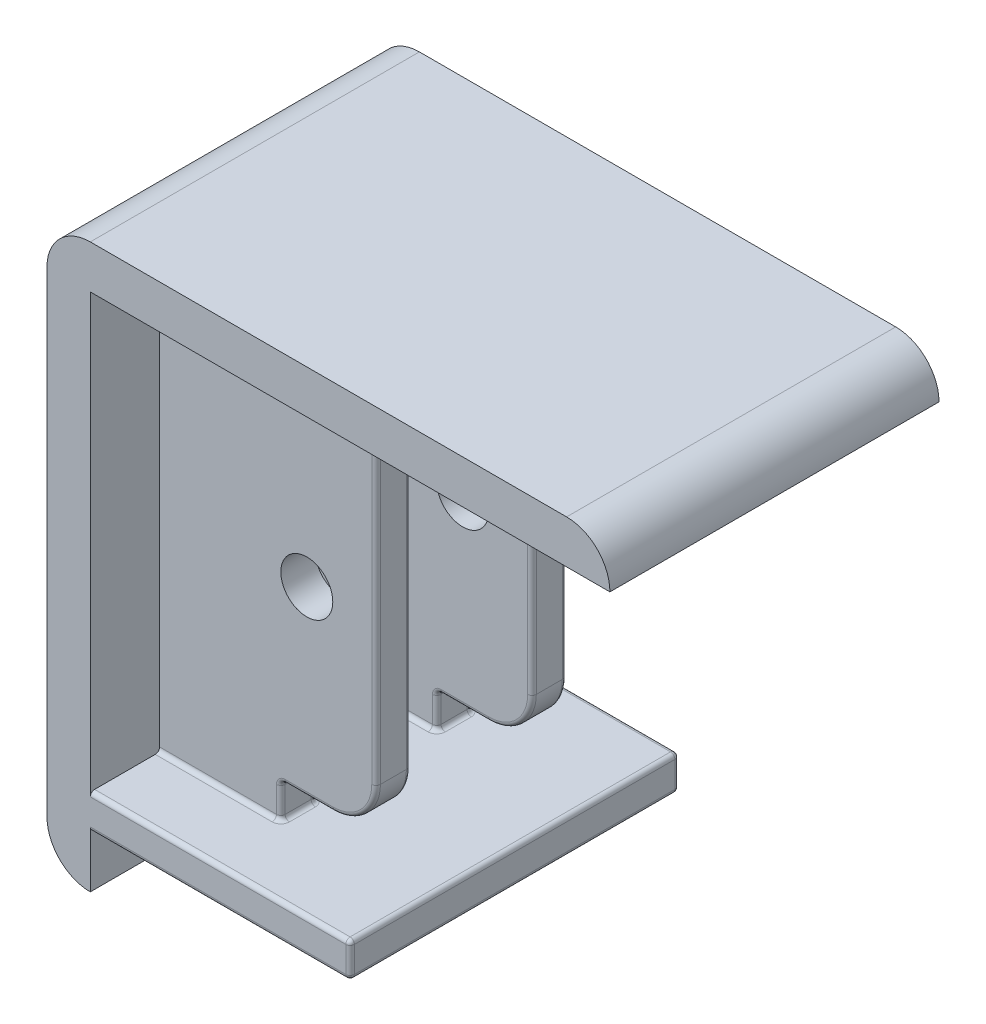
ISO-10303-21;
HEADER;
FILE_DESCRIPTION(('STEP AP214'),'2;1');
FILE_NAME('part.step','',(''),(''),'','','');
FILE_SCHEMA(('AUTOMOTIVE_DESIGN { 1 0 10303 214 1 1 1 1 }'));
ENDSEC;
DATA;
#1=APPLICATION_CONTEXT('core data for automotive mechanical design processes');
#2=APPLICATION_PROTOCOL_DEFINITION('international standard','automotive_design',2000,#1);
#3=PRODUCT_CONTEXT('',#1,'mechanical');
#4=PRODUCT('Part','Part','',(#3));
#5=PRODUCT_RELATED_PRODUCT_CATEGORY('part','',(#4));
#6=PRODUCT_DEFINITION_FORMATION('','',#4);
#7=PRODUCT_DEFINITION_CONTEXT('part definition',#1,'design');
#8=PRODUCT_DEFINITION('design','',#6,#7);
#9=PRODUCT_DEFINITION_SHAPE('','',#8);
#10=(LENGTH_UNIT() NAMED_UNIT(*) SI_UNIT(.MILLI.,.METRE.));
#11=(NAMED_UNIT(*) PLANE_ANGLE_UNIT() SI_UNIT($,.RADIAN.));
#12=(NAMED_UNIT(*) SI_UNIT($,.STERADIAN.) SOLID_ANGLE_UNIT());
#13=UNCERTAINTY_MEASURE_WITH_UNIT(LENGTH_MEASURE(1.E-05),#10,'distance_accuracy_value','');
#14=(GEOMETRIC_REPRESENTATION_CONTEXT(3) GLOBAL_UNCERTAINTY_ASSIGNED_CONTEXT((#13)) GLOBAL_UNIT_ASSIGNED_CONTEXT((#10,
#11,#12)) REPRESENTATION_CONTEXT('',''));
#15=CARTESIAN_POINT('',(0.,0.,0.));
#16=DIRECTION('',(0.,0.,1.));
#17=DIRECTION('',(1.,0.,0.));
#18=AXIS2_PLACEMENT_3D('',#15,#16,#17);
#19=CARTESIAN_POINT('',(2.5,-2.5,19.));
#20=DIRECTION('',(-1.,0.,0.));
#21=DIRECTION('',(0.,-1.,0.));
#22=AXIS2_PLACEMENT_3D('',#19,#20,#21);
#23=PLANE('',#22);
#24=DIRECTION('',(0.,1.,0.));
#25=VECTOR('',#24,1.);
#26=CARTESIAN_POINT('',(2.5,-25.5,4.));
#27=LINE('',#26,#25);
#28=CARTESIAN_POINT('',(2.5,-27.25,4.));
#29=VERTEX_POINT('',#28);
#30=CARTESIAN_POINT('',(2.5,-2.75,4.));
#31=VERTEX_POINT('',#30);
#32=EDGE_CURVE('E833',#29,#31,#27,.T.);
#33=ORIENTED_EDGE('',*,*,#32,.F.);
#34=CARTESIAN_POINT('',(2.5,-27.25,3.75));
#35=DIRECTION('',(-1.,0.,0.));
#36=DIRECTION('',(0.,-1.,0.));
#37=AXIS2_PLACEMENT_3D('',#34,#35,#36);
#38=CIRCLE('',#37,0.25);
#39=CARTESIAN_POINT('',(2.5,-27.5,3.75));
#40=VERTEX_POINT('',#39);
#41=EDGE_CURVE('E667',#29,#40,#38,.F.);
#42=ORIENTED_EDGE('',*,*,#41,.T.);
#43=DIRECTION('',(0.,0.,-1.));
#44=VECTOR('',#43,1.);
#45=CARTESIAN_POINT('',(2.5,-27.5,19.));
#46=LINE('',#45,#44);
#47=CARTESIAN_POINT('',(2.5,-27.5,0.25));
#48=VERTEX_POINT('',#47);
#49=EDGE_CURVE('E825',#40,#48,#46,.T.);
#50=ORIENTED_EDGE('',*,*,#49,.T.);
#51=CARTESIAN_POINT('',(2.5,-27.75,0.25));
#52=DIRECTION('',(-1.,0.,0.));
#53=DIRECTION('',(0.,-1.,0.));
#54=AXIS2_PLACEMENT_3D('',#51,#52,#53);
#55=CIRCLE('',#54,0.25);
#56=CARTESIAN_POINT('',(2.5,-27.75,0.));
#57=VERTEX_POINT('',#56);
#58=EDGE_CURVE('E614',#48,#57,#55,.T.);
#59=ORIENTED_EDGE('',*,*,#58,.T.);
#60=DIRECTION('',(0.,1.,0.));
#61=VECTOR('',#60,1.);
#62=CARTESIAN_POINT('',(2.5,-2.5,0.));
#63=LINE('',#62,#61);
#64=CARTESIAN_POINT('',(2.5,-2.5,0.));
#65=VERTEX_POINT('',#64);
#66=EDGE_CURVE('E418',#57,#65,#63,.T.);
#67=ORIENTED_EDGE('',*,*,#66,.T.);
#68=DIRECTION('',(0.,0.,-1.));
#69=VECTOR('',#68,1.);
#70=CARTESIAN_POINT('',(2.5,-2.5,19.));
#71=LINE('',#70,#69);
#72=CARTESIAN_POINT('',(2.5,-2.5,3.75));
#73=VERTEX_POINT('',#72);
#74=EDGE_CURVE('E443',#73,#65,#71,.T.);
#75=ORIENTED_EDGE('',*,*,#74,.F.);
#76=CARTESIAN_POINT('',(2.5,-2.75,3.75));
#77=DIRECTION('',(-1.,0.,0.));
#78=DIRECTION('',(0.,-1.,0.));
#79=AXIS2_PLACEMENT_3D('',#76,#77,#78);
#80=CIRCLE('',#79,0.25);
#81=EDGE_CURVE('E565',#73,#31,#80,.F.);
#82=ORIENTED_EDGE('',*,*,#81,.T.);
#83=EDGE_LOOP('',(#33,#42,#50,#59,#67,#75,#82));
#84=FACE_BOUND('',#83,.T.);
#85=ADVANCED_FACE('F30',(#84),#23,.F.);
#86=DIRECTION('',(0.,1.,0.));
#87=VECTOR('',#86,1.);
#88=CARTESIAN_POINT('',(2.5,-25.5,13.));
#89=LINE('',#88,#87);
#90=CARTESIAN_POINT('',(2.5,-27.25,13.));
#91=VERTEX_POINT('',#90);
#92=CARTESIAN_POINT('',(2.5,-2.75,13.));
#93=VERTEX_POINT('',#92);
#94=EDGE_CURVE('E838',#91,#93,#89,.T.);
#95=ORIENTED_EDGE('',*,*,#94,.F.);
#96=CARTESIAN_POINT('',(2.5,-27.25,12.75));
#97=DIRECTION('',(-1.,0.,0.));
#98=DIRECTION('',(0.,-1.,0.));
#99=AXIS2_PLACEMENT_3D('',#96,#97,#98);
#100=CIRCLE('',#99,0.25);
#101=CARTESIAN_POINT('',(2.5,-27.5,12.75));
#102=VERTEX_POINT('',#101);
#103=EDGE_CURVE('E655',#91,#102,#100,.F.);
#104=ORIENTED_EDGE('',*,*,#103,.T.);
#105=CARTESIAN_POINT('',(2.5,-27.5,6.25));
#106=VERTEX_POINT('',#105);
#107=EDGE_CURVE('E830',#102,#106,#46,.T.);
#108=ORIENTED_EDGE('',*,*,#107,.T.);
#109=CARTESIAN_POINT('',(2.5,-27.25,6.25));
#110=DIRECTION('',(-1.,0.,0.));
#111=DIRECTION('',(0.,-1.,0.));
#112=AXIS2_PLACEMENT_3D('',#109,#110,#111);
#113=CIRCLE('',#112,0.25);
#114=CARTESIAN_POINT('',(2.5,-27.25,6.));
#115=VERTEX_POINT('',#114);
#116=EDGE_CURVE('E653',#106,#115,#113,.F.);
#117=ORIENTED_EDGE('',*,*,#116,.T.);
#118=DIRECTION('',(0.,1.,0.));
#119=VECTOR('',#118,1.);
#120=CARTESIAN_POINT('',(2.5,-25.5,6.));
#121=LINE('',#120,#119);
#122=CARTESIAN_POINT('',(2.5,-2.75,6.));
#123=VERTEX_POINT('',#122);
#124=EDGE_CURVE('E835',#115,#123,#121,.T.);
#125=ORIENTED_EDGE('',*,*,#124,.T.);
#126=CARTESIAN_POINT('',(2.5,-2.75,6.25));
#127=DIRECTION('',(-1.,0.,0.));
#128=DIRECTION('',(0.,-1.,0.));
#129=AXIS2_PLACEMENT_3D('',#126,#127,#128);
#130=CIRCLE('',#129,0.25);
#131=CARTESIAN_POINT('',(2.5,-2.5,6.25));
#132=VERTEX_POINT('',#131);
#133=EDGE_CURVE('E568',#123,#132,#130,.F.);
#134=ORIENTED_EDGE('',*,*,#133,.T.);
#135=CARTESIAN_POINT('',(2.5,-2.5,12.75));
#136=VERTEX_POINT('',#135);
#137=EDGE_CURVE('E445',#136,#132,#71,.T.);
#138=ORIENTED_EDGE('',*,*,#137,.F.);
#139=CARTESIAN_POINT('',(2.5,-2.75,12.75));
#140=DIRECTION('',(-1.,0.,0.));
#141=DIRECTION('',(0.,-1.,0.));
#142=AXIS2_PLACEMENT_3D('',#139,#140,#141);
#143=CIRCLE('',#142,0.25);
#144=EDGE_CURVE('E516',#136,#93,#143,.F.);
#145=ORIENTED_EDGE('',*,*,#144,.T.);
#146=EDGE_LOOP('',(#95,#104,#108,#117,#125,#134,#138,#145));
#147=FACE_BOUND('',#146,.T.);
#148=ADVANCED_FACE('F991',(#147),#23,.F.);
#149=CARTESIAN_POINT('',(2.5,-27.5,18.75));
#150=VERTEX_POINT('',#149);
#151=CARTESIAN_POINT('',(2.5,-27.5,15.25));
#152=VERTEX_POINT('',#151);
#153=EDGE_CURVE('E826',#150,#152,#46,.T.);
#154=ORIENTED_EDGE('',*,*,#153,.T.);
#155=CARTESIAN_POINT('',(2.5,-27.25,15.25));
#156=DIRECTION('',(-1.,0.,0.));
#157=DIRECTION('',(0.,-1.,0.));
#158=AXIS2_PLACEMENT_3D('',#155,#156,#157);
#159=CIRCLE('',#158,0.25);
#160=CARTESIAN_POINT('',(2.5,-27.25,15.));
#161=VERTEX_POINT('',#160);
#162=EDGE_CURVE('E657',#152,#161,#159,.F.);
#163=ORIENTED_EDGE('',*,*,#162,.T.);
#164=DIRECTION('',(0.,1.,0.));
#165=VECTOR('',#164,1.);
#166=CARTESIAN_POINT('',(2.5,-25.5,15.));
#167=LINE('',#166,#165);
#168=CARTESIAN_POINT('',(2.5,-2.75,15.));
#169=VERTEX_POINT('',#168);
#170=EDGE_CURVE('E837',#161,#169,#167,.T.);
#171=ORIENTED_EDGE('',*,*,#170,.T.);
#172=CARTESIAN_POINT('',(2.5,-2.75,15.25));
#173=DIRECTION('',(-1.,0.,0.));
#174=DIRECTION('',(0.,-1.,0.));
#175=AXIS2_PLACEMENT_3D('',#172,#173,#174);
#176=CIRCLE('',#175,0.25);
#177=CARTESIAN_POINT('',(2.5,-2.5,15.25));
#178=VERTEX_POINT('',#177);
#179=EDGE_CURVE('E519',#169,#178,#176,.F.);
#180=ORIENTED_EDGE('',*,*,#179,.T.);
#181=CARTESIAN_POINT('',(2.5,-2.5,19.));
#182=VERTEX_POINT('',#181);
#183=EDGE_CURVE('E410',#182,#178,#71,.T.);
#184=ORIENTED_EDGE('',*,*,#183,.F.);
#185=DIRECTION('',(0.,1.,0.));
#186=VECTOR('',#185,1.);
#187=CARTESIAN_POINT('',(2.5,-2.5,19.));
#188=LINE('',#187,#186);
#189=CARTESIAN_POINT('',(2.5,-27.75,19.));
#190=VERTEX_POINT('',#189);
#191=EDGE_CURVE('E433',#190,#182,#188,.T.);
#192=ORIENTED_EDGE('',*,*,#191,.F.);
#193=CARTESIAN_POINT('',(2.5,-27.75,18.75));
#194=DIRECTION('',(-1.,0.,0.));
#195=DIRECTION('',(0.,-1.,0.));
#196=AXIS2_PLACEMENT_3D('',#193,#194,#195);
#197=CIRCLE('',#196,0.25);
#198=EDGE_CURVE('E619',#190,#150,#197,.T.);
#199=ORIENTED_EDGE('',*,*,#198,.T.);
#200=EDGE_LOOP('',(#154,#163,#171,#180,#184,#192,#199));
#201=FACE_BOUND('',#200,.T.);
#202=ADVANCED_FACE('F961',(#201),#23,.F.);
#203=CARTESIAN_POINT('',(2.5,-32.5,0.));
#204=VERTEX_POINT('',#203);
#205=CARTESIAN_POINT('',(2.5,-29.25,0.));
#206=VERTEX_POINT('',#205);
#207=EDGE_CURVE('E405',#204,#206,#63,.T.);
#208=ORIENTED_EDGE('',*,*,#207,.T.);
#209=CARTESIAN_POINT('',(2.5,-29.25,0.25));
#210=DIRECTION('',(-1.,0.,0.));
#211=DIRECTION('',(0.,-1.,0.));
#212=AXIS2_PLACEMENT_3D('',#209,#210,#211);
#213=CIRCLE('',#212,0.25);
#214=CARTESIAN_POINT('',(2.5,-29.5,0.25));
#215=VERTEX_POINT('',#214);
#216=EDGE_CURVE('E617',#206,#215,#213,.T.);
#217=ORIENTED_EDGE('',*,*,#216,.T.);
#218=DIRECTION('',(0.,0.,-1.));
#219=VECTOR('',#218,1.);
#220=CARTESIAN_POINT('',(2.5,-29.5,19.));
#221=LINE('',#220,#219);
#222=CARTESIAN_POINT('',(2.5,-29.5,18.75));
#223=VERTEX_POINT('',#222);
#224=EDGE_CURVE('E829',#223,#215,#221,.T.);
#225=ORIENTED_EDGE('',*,*,#224,.F.);
#226=CARTESIAN_POINT('',(2.5,-29.25,18.75));
#227=DIRECTION('',(-1.,0.,0.));
#228=DIRECTION('',(0.,-1.,0.));
#229=AXIS2_PLACEMENT_3D('',#226,#227,#228);
#230=CIRCLE('',#229,0.25);
#231=CARTESIAN_POINT('',(2.5,-29.25,19.));
#232=VERTEX_POINT('',#231);
#233=EDGE_CURVE('E621',#223,#232,#230,.T.);
#234=ORIENTED_EDGE('',*,*,#233,.T.);
#235=CARTESIAN_POINT('',(2.5,-32.5,19.));
#236=VERTEX_POINT('',#235);
#237=EDGE_CURVE('E408',#236,#232,#188,.T.);
#238=ORIENTED_EDGE('',*,*,#237,.F.);
#239=DIRECTION('',(0.,0.,-1.));
#240=VECTOR('',#239,1.);
#241=CARTESIAN_POINT('',(2.5,-32.5,19.));
#242=LINE('',#241,#240);
#243=EDGE_CURVE('E394',#236,#204,#242,.T.);
#244=ORIENTED_EDGE('',*,*,#243,.T.);
#245=EDGE_LOOP('',(#208,#217,#225,#234,#238,#244));
#246=FACE_BOUND('',#245,.T.);
#247=ADVANCED_FACE('F404',(#246),#23,.F.);
#248=CARTESIAN_POINT('',(2.5,-25.5,13.));
#249=DIRECTION('',(0.,-1.,0.));
#250=DIRECTION('',(1.,0.,0.));
#251=AXIS2_PLACEMENT_3D('',#248,#249,#250);
#252=PLANE('',#251);
#253=DIRECTION('',(-1.,0.,0.));
#254=VECTOR('',#253,1.);
#255=CARTESIAN_POINT('',(9.5,-25.5,14.75));
#256=LINE('',#255,#254);
#257=CARTESIAN_POINT('',(12.5,-25.5,14.75));
#258=VERTEX_POINT('',#257);
#259=CARTESIAN_POINT('',(9.75,-25.5,14.75));
#260=VERTEX_POINT('',#259);
#261=EDGE_CURVE('E476',#258,#260,#256,.T.);
#262=ORIENTED_EDGE('',*,*,#261,.T.);
#263=DIRECTION('',(0.,0.,1.));
#264=VECTOR('',#263,1.);
#265=CARTESIAN_POINT('',(9.75,-25.5,13.));
#266=LINE('',#265,#264);
#267=CARTESIAN_POINT('',(9.75,-25.5,13.25));
#268=VERTEX_POINT('',#267);
#269=EDGE_CURVE('E684',#260,#268,#266,.F.);
#270=ORIENTED_EDGE('',*,*,#269,.T.);
#271=DIRECTION('',(1.,0.,0.));
#272=VECTOR('',#271,1.);
#273=CARTESIAN_POINT('',(12.5,-25.5,13.25));
#274=LINE('',#273,#272);
#275=CARTESIAN_POINT('',(12.5,-25.5,13.25));
#276=VERTEX_POINT('',#275);
#277=EDGE_CURVE('E484',#268,#276,#274,.T.);
#278=ORIENTED_EDGE('',*,*,#277,.T.);
#279=DIRECTION('',(0.,0.,1.));
#280=VECTOR('',#279,1.);
#281=CARTESIAN_POINT('',(12.5,-25.5,15.));
#282=LINE('',#281,#280);
#283=EDGE_CURVE('E464',#276,#258,#282,.T.);
#284=ORIENTED_EDGE('',*,*,#283,.T.);
#285=EDGE_LOOP('',(#262,#270,#278,#284));
#286=FACE_BOUND('',#285,.T.);
#287=ADVANCED_FACE('F1116',(#286),#252,.T.);
#288=CARTESIAN_POINT('',(15.,-25.5,4.));
#289=DIRECTION('',(0.,-1.,0.));
#290=DIRECTION('',(1.,0.,0.));
#291=AXIS2_PLACEMENT_3D('',#288,#289,#290);
#292=PLANE('',#291);
#293=DIRECTION('',(-1.,0.,0.));
#294=VECTOR('',#293,1.);
#295=CARTESIAN_POINT('',(9.5,-25.5,5.75));
#296=LINE('',#295,#294);
#297=CARTESIAN_POINT('',(12.5,-25.5,5.75));
#298=VERTEX_POINT('',#297);
#299=CARTESIAN_POINT('',(9.75000000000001,-25.5,5.75));
#300=VERTEX_POINT('',#299);
#301=EDGE_CURVE('E531',#298,#300,#296,.T.);
#302=ORIENTED_EDGE('',*,*,#301,.T.);
#303=DIRECTION('',(0.,0.,1.));
#304=VECTOR('',#303,1.);
#305=CARTESIAN_POINT('',(9.75000000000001,-25.5,4.));
#306=LINE('',#305,#304);
#307=CARTESIAN_POINT('',(9.75000000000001,-25.5,4.25));
#308=VERTEX_POINT('',#307);
#309=EDGE_CURVE('E45',#300,#308,#306,.F.);
#310=ORIENTED_EDGE('',*,*,#309,.T.);
#311=DIRECTION('',(1.,0.,0.));
#312=VECTOR('',#311,1.);
#313=CARTESIAN_POINT('',(12.5,-25.5,4.25));
#314=LINE('',#313,#312);
#315=CARTESIAN_POINT('',(12.5,-25.5,4.25));
#316=VERTEX_POINT('',#315);
#317=EDGE_CURVE('E533',#308,#316,#314,.T.);
#318=ORIENTED_EDGE('',*,*,#317,.T.);
#319=DIRECTION('',(0.,0.,1.));
#320=VECTOR('',#319,1.);
#321=CARTESIAN_POINT('',(12.5,-25.5,6.));
#322=LINE('',#321,#320);
#323=EDGE_CURVE('E470',#316,#298,#322,.T.);
#324=ORIENTED_EDGE('',*,*,#323,.T.);
#325=EDGE_LOOP('',(#302,#310,#318,#324));
#326=FACE_BOUND('',#325,.T.);
#327=ADVANCED_FACE('F1166',(#326),#292,.T.);
#328=CARTESIAN_POINT('',(2.5,-2.5,19.));
#329=DIRECTION('',(0.,1.,0.));
#330=DIRECTION('',(-1.,0.,0.));
#331=AXIS2_PLACEMENT_3D('',#328,#329,#330);
#332=PLANE('',#331);
#333=CARTESIAN_POINT('',(14.75,-2.5,4.25));
#334=DIRECTION('',(0.,1.,0.));
#335=DIRECTION('',(-1.,0.,0.));
#336=AXIS2_PLACEMENT_3D('',#333,#334,#335);
#337=CIRCLE('',#336,0.5);
#338=CARTESIAN_POINT('',(14.75,-2.5,3.75));
#339=VERTEX_POINT('',#338);
#340=CARTESIAN_POINT('',(15.25,-2.5,4.25));
#341=VERTEX_POINT('',#340);
#342=EDGE_CURVE('E553',#339,#341,#337,.F.);
#343=ORIENTED_EDGE('',*,*,#342,.F.);
#344=DIRECTION('',(1.,0.,0.));
#345=VECTOR('',#344,1.);
#346=CARTESIAN_POINT('',(2.5,-2.5,3.75));
#347=LINE('',#346,#345);
#348=EDGE_CURVE('E563',#339,#73,#347,.F.);
#349=ORIENTED_EDGE('',*,*,#348,.T.);
#350=ORIENTED_EDGE('',*,*,#74,.T.);
#351=DIRECTION('',(1.,0.,0.));
#352=VECTOR('',#351,1.);
#353=CARTESIAN_POINT('',(2.5,-2.5,0.));
#354=LINE('',#353,#352);
#355=CARTESIAN_POINT('',(32.5,-2.5,0.));
#356=VERTEX_POINT('',#355);
#357=EDGE_CURVE('E417',#65,#356,#354,.T.);
#358=ORIENTED_EDGE('',*,*,#357,.T.);
#359=DIRECTION('',(0.,0.,-1.));
#360=VECTOR('',#359,1.);
#361=CARTESIAN_POINT('',(32.5,-2.5,19.));
#362=LINE('',#361,#360);
#363=CARTESIAN_POINT('',(32.5,-2.5,19.));
#364=VERTEX_POINT('',#363);
#365=EDGE_CURVE('E440',#364,#356,#362,.T.);
#366=ORIENTED_EDGE('',*,*,#365,.F.);
#367=DIRECTION('',(1.,0.,0.));
#368=VECTOR('',#367,1.);
#369=CARTESIAN_POINT('',(2.5,-2.5,19.));
#370=LINE('',#369,#368);
#371=EDGE_CURVE('E435',#182,#364,#370,.T.);
#372=ORIENTED_EDGE('',*,*,#371,.F.);
#373=ORIENTED_EDGE('',*,*,#183,.T.);
#374=DIRECTION('',(-1.,0.,0.));
#375=VECTOR('',#374,1.);
#376=CARTESIAN_POINT('',(15.,-2.5,15.25));
#377=LINE('',#376,#375);
#378=CARTESIAN_POINT('',(14.75,-2.5,15.25));
#379=VERTEX_POINT('',#378);
#380=EDGE_CURVE('E512',#178,#379,#377,.F.);
#381=ORIENTED_EDGE('',*,*,#380,.T.);
#382=CARTESIAN_POINT('',(14.75,-2.5,14.75));
#383=DIRECTION('',(0.,1.,0.));
#384=DIRECTION('',(-1.,0.,0.));
#385=AXIS2_PLACEMENT_3D('',#382,#383,#384);
#386=CIRCLE('',#385,0.5);
#387=CARTESIAN_POINT('',(15.25,-2.5,14.75));
#388=VERTEX_POINT('',#387);
#389=EDGE_CURVE('E509',#388,#379,#386,.F.);
#390=ORIENTED_EDGE('',*,*,#389,.F.);
#391=DIRECTION('',(0.,0.,1.));
#392=VECTOR('',#391,1.);
#393=CARTESIAN_POINT('',(15.25,-2.5,13.));
#394=LINE('',#393,#392);
#395=CARTESIAN_POINT('',(15.25,-2.5,13.25));
#396=VERTEX_POINT('',#395);
#397=EDGE_CURVE('E507',#388,#396,#394,.F.);
#398=ORIENTED_EDGE('',*,*,#397,.T.);
#399=CARTESIAN_POINT('',(14.75,-2.5,13.25));
#400=DIRECTION('',(0.,1.,0.));
#401=DIRECTION('',(-1.,0.,0.));
#402=AXIS2_PLACEMENT_3D('',#399,#400,#401);
#403=CIRCLE('',#402,0.5);
#404=CARTESIAN_POINT('',(14.75,-2.5,12.75));
#405=VERTEX_POINT('',#404);
#406=EDGE_CURVE('E504',#405,#396,#403,.F.);
#407=ORIENTED_EDGE('',*,*,#406,.F.);
#408=DIRECTION('',(1.,0.,0.));
#409=VECTOR('',#408,1.);
#410=CARTESIAN_POINT('',(2.5,-2.5,12.75));
#411=LINE('',#410,#409);
#412=EDGE_CURVE('E514',#405,#136,#411,.F.);
#413=ORIENTED_EDGE('',*,*,#412,.T.);
#414=ORIENTED_EDGE('',*,*,#137,.T.);
#415=DIRECTION('',(-1.,0.,0.));
#416=VECTOR('',#415,1.);
#417=CARTESIAN_POINT('',(15.,-2.5,6.25));
#418=LINE('',#417,#416);
#419=CARTESIAN_POINT('',(14.75,-2.5,6.25));
#420=VERTEX_POINT('',#419);
#421=EDGE_CURVE('E561',#132,#420,#418,.F.);
#422=ORIENTED_EDGE('',*,*,#421,.T.);
#423=CARTESIAN_POINT('',(14.75,-2.5,5.75));
#424=DIRECTION('',(0.,1.,0.));
#425=DIRECTION('',(-1.,0.,0.));
#426=AXIS2_PLACEMENT_3D('',#423,#424,#425);
#427=CIRCLE('',#426,0.5);
#428=CARTESIAN_POINT('',(15.25,-2.5,5.75));
#429=VERTEX_POINT('',#428);
#430=EDGE_CURVE('E558',#429,#420,#427,.F.);
#431=ORIENTED_EDGE('',*,*,#430,.F.);
#432=DIRECTION('',(0.,0.,1.));
#433=VECTOR('',#432,1.);
#434=CARTESIAN_POINT('',(15.25,-2.5,4.));
#435=LINE('',#434,#433);
#436=EDGE_CURVE('E556',#429,#341,#435,.F.);
#437=ORIENTED_EDGE('',*,*,#436,.T.);
#438=EDGE_LOOP('',(#343,#349,#350,#358,#366,#372,#373,#381,#390,#398,#407,#413,#414,#422,#431,#437));
#439=FACE_BOUND('',#438,.T.);
#440=ADVANCED_FACE('F861',(#439),#332,.F.);
#441=CARTESIAN_POINT('',(0.,0.,19.));
#442=DIRECTION('',(1.,0.,0.));
#443=DIRECTION('',(0.,1.,0.));
#444=AXIS2_PLACEMENT_3D('',#441,#442,#443);
#445=PLANE('',#444);
#446=DIRECTION('',(0.,-1.,0.));
#447=VECTOR('',#446,1.);
#448=CARTESIAN_POINT('',(0.,0.,0.));
#449=LINE('',#448,#447);
#450=CARTESIAN_POINT('',(0.,-2.5,0.));
#451=VERTEX_POINT('',#450);
#452=CARTESIAN_POINT('',(0.,-30.,0.));
#453=VERTEX_POINT('',#452);
#454=EDGE_CURVE('E424',#451,#453,#449,.T.);
#455=ORIENTED_EDGE('',*,*,#454,.T.);
#456=DIRECTION('',(0.,0.,-1.));
#457=VECTOR('',#456,1.);
#458=CARTESIAN_POINT('',(0.,-30.,19.));
#459=LINE('',#458,#457);
#460=CARTESIAN_POINT('',(0.,-30.,19.));
#461=VERTEX_POINT('',#460);
#462=EDGE_CURVE('E395',#453,#461,#459,.F.);
#463=ORIENTED_EDGE('',*,*,#462,.T.);
#464=DIRECTION('',(0.,-1.,0.));
#465=VECTOR('',#464,1.);
#466=CARTESIAN_POINT('',(0.,0.,19.));
#467=LINE('',#466,#465);
#468=CARTESIAN_POINT('',(0.,-2.5,19.));
#469=VERTEX_POINT('',#468);
#470=EDGE_CURVE('E430',#469,#461,#467,.T.);
#471=ORIENTED_EDGE('',*,*,#470,.F.);
#472=DIRECTION('',(0.,0.,-1.));
#473=VECTOR('',#472,1.);
#474=CARTESIAN_POINT('',(0.,-2.5,19.));
#475=LINE('',#474,#473);
#476=EDGE_CURVE('E453',#469,#451,#475,.T.);
#477=ORIENTED_EDGE('',*,*,#476,.T.);
#478=EDGE_LOOP('',(#455,#463,#471,#477));
#479=FACE_BOUND('',#478,.T.);
#480=ADVANCED_FACE('F32',(#479),#445,.F.);
#481=CARTESIAN_POINT('',(0.,0.,19.));
#482=DIRECTION('',(0.,-1.,0.));
#483=DIRECTION('',(0.,0.,-1.));
#484=AXIS2_PLACEMENT_3D('',#481,#482,#483);
#485=PLANE('',#484);
#486=DIRECTION('',(-1.,0.,0.));
#487=VECTOR('',#486,1.);
#488=CARTESIAN_POINT('',(0.,0.,0.));
#489=LINE('',#488,#487);
#490=CARTESIAN_POINT('',(30.,0.,0.));
#491=VERTEX_POINT('',#490);
#492=CARTESIAN_POINT('',(2.5,0.,0.));
#493=VERTEX_POINT('',#492);
#494=EDGE_CURVE('E421',#491,#493,#489,.T.);
#495=ORIENTED_EDGE('',*,*,#494,.T.);
#496=DIRECTION('',(0.,0.,-1.));
#497=VECTOR('',#496,1.);
#498=CARTESIAN_POINT('',(2.5,0.,19.));
#499=LINE('',#498,#497);
#500=CARTESIAN_POINT('',(2.5,0.,19.));
#501=VERTEX_POINT('',#500);
#502=EDGE_CURVE('E458',#493,#501,#499,.F.);
#503=ORIENTED_EDGE('',*,*,#502,.T.);
#504=DIRECTION('',(-1.,0.,0.));
#505=VECTOR('',#504,1.);
#506=CARTESIAN_POINT('',(0.,0.,19.));
#507=LINE('',#506,#505);
#508=CARTESIAN_POINT('',(30.,0.,19.));
#509=VERTEX_POINT('',#508);
#510=EDGE_CURVE('E437',#509,#501,#507,.T.);
#511=ORIENTED_EDGE('',*,*,#510,.F.);
#512=DIRECTION('',(0.,0.,-1.));
#513=VECTOR('',#512,1.);
#514=CARTESIAN_POINT('',(30.,0.,19.));
#515=LINE('',#514,#513);
#516=EDGE_CURVE('E409',#509,#491,#515,.T.);
#517=ORIENTED_EDGE('',*,*,#516,.T.);
#518=EDGE_LOOP('',(#495,#503,#511,#517));
#519=FACE_BOUND('',#518,.T.);
#520=ADVANCED_FACE('F848',(#519),#485,.F.);
#521=CARTESIAN_POINT('',(0.,0.,19.));
#522=DIRECTION('',(0.,0.,1.));
#523=DIRECTION('',(1.,0.,0.));
#524=AXIS2_PLACEMENT_3D('',#521,#522,#523);
#525=PLANE('',#524);
#526=DIRECTION('',(-1.,0.,0.));
#527=VECTOR('',#526,1.);
#528=CARTESIAN_POINT('',(2.5,-27.75,19.));
#529=LINE('',#528,#527);
#530=CARTESIAN_POINT('',(17.25,-27.75,19.));
#531=VERTEX_POINT('',#530);
#532=EDGE_CURVE('E604',#531,#190,#529,.T.);
#533=ORIENTED_EDGE('',*,*,#532,.T.);
#534=ORIENTED_EDGE('',*,*,#191,.T.);
#535=ORIENTED_EDGE('',*,*,#371,.T.);
#536=CARTESIAN_POINT('',(30.,-2.5,19.));
#537=DIRECTION('',(0.,0.,1.));
#538=DIRECTION('',(1.,0.,0.));
#539=AXIS2_PLACEMENT_3D('',#536,#537,#538);
#540=CIRCLE('',#539,2.5);
#541=EDGE_CURVE('E451',#364,#509,#540,.T.);
#542=ORIENTED_EDGE('',*,*,#541,.T.);
#543=ORIENTED_EDGE('',*,*,#510,.T.);
#544=CARTESIAN_POINT('',(2.5,-2.5,19.));
#545=DIRECTION('',(0.,0.,1.));
#546=DIRECTION('',(1.,0.,0.));
#547=AXIS2_PLACEMENT_3D('',#544,#545,#546);
#548=CIRCLE('',#547,2.5);
#549=EDGE_CURVE('E400',#501,#469,#548,.T.);
#550=ORIENTED_EDGE('',*,*,#549,.T.);
#551=ORIENTED_EDGE('',*,*,#470,.T.);
#552=CARTESIAN_POINT('',(2.5,-30.,19.));
#553=DIRECTION('',(0.,0.,1.));
#554=DIRECTION('',(1.,0.,0.));
#555=AXIS2_PLACEMENT_3D('',#552,#553,#554);
#556=CIRCLE('',#555,2.5);
#557=EDGE_CURVE('E462',#461,#236,#556,.T.);
#558=ORIENTED_EDGE('',*,*,#557,.T.);
#559=ORIENTED_EDGE('',*,*,#237,.T.);
#560=DIRECTION('',(-1.,0.,0.));
#561=VECTOR('',#560,1.);
#562=CARTESIAN_POINT('',(0.,-29.25,19.));
#563=LINE('',#562,#561);
#564=CARTESIAN_POINT('',(17.25,-29.25,19.));
#565=VERTEX_POINT('',#564);
#566=EDGE_CURVE('E600',#232,#565,#563,.F.);
#567=ORIENTED_EDGE('',*,*,#566,.T.);
#568=DIRECTION('',(0.,1.,0.));
#569=VECTOR('',#568,1.);
#570=CARTESIAN_POINT('',(17.25,-27.5,19.));
#571=LINE('',#570,#569);
#572=EDGE_CURVE('E602',#565,#531,#571,.T.);
#573=ORIENTED_EDGE('',*,*,#572,.T.);
#574=EDGE_LOOP('',(#533,#534,#535,#542,#543,#550,#551,#558,#559,#567,#573));
#575=FACE_BOUND('',#574,.T.);
#576=ADVANCED_FACE('F854',(#575),#525,.T.);
#577=CARTESIAN_POINT('',(0.,0.,0.));
#578=DIRECTION('',(0.,0.,1.));
#579=DIRECTION('',(1.,0.,0.));
#580=AXIS2_PLACEMENT_3D('',#577,#578,#579);
#581=PLANE('',#580);
#582=ORIENTED_EDGE('',*,*,#66,.F.);
#583=DIRECTION('',(1.,0.,0.));
#584=VECTOR('',#583,1.);
#585=CARTESIAN_POINT('',(0.,-27.75,0.));
#586=LINE('',#585,#584);
#587=CARTESIAN_POINT('',(17.25,-27.75,0.));
#588=VERTEX_POINT('',#587);
#589=EDGE_CURVE('E592',#57,#588,#586,.T.);
#590=ORIENTED_EDGE('',*,*,#589,.T.);
#591=DIRECTION('',(0.,1.,0.));
#592=VECTOR('',#591,1.);
#593=CARTESIAN_POINT('',(17.25,0.,0.));
#594=LINE('',#593,#592);
#595=CARTESIAN_POINT('',(17.25,-29.25,0.));
#596=VERTEX_POINT('',#595);
#597=EDGE_CURVE('E590',#588,#596,#594,.F.);
#598=ORIENTED_EDGE('',*,*,#597,.T.);
#599=DIRECTION('',(1.,0.,0.));
#600=VECTOR('',#599,1.);
#601=CARTESIAN_POINT('',(2.5,-29.25,0.));
#602=LINE('',#601,#600);
#603=EDGE_CURVE('E415',#596,#206,#602,.F.);
#604=ORIENTED_EDGE('',*,*,#603,.T.);
#605=ORIENTED_EDGE('',*,*,#207,.F.);
#606=CARTESIAN_POINT('',(2.5,-30.,0.));
#607=DIRECTION('',(0.,0.,1.));
#608=DIRECTION('',(1.,0.,0.));
#609=AXIS2_PLACEMENT_3D('',#606,#607,#608);
#610=CIRCLE('',#609,2.5);
#611=EDGE_CURVE('E390',#204,#453,#610,.F.);
#612=ORIENTED_EDGE('',*,*,#611,.T.);
#613=ORIENTED_EDGE('',*,*,#454,.F.);
#614=CARTESIAN_POINT('',(2.5,-2.5,0.));
#615=DIRECTION('',(0.,0.,1.));
#616=DIRECTION('',(1.,0.,0.));
#617=AXIS2_PLACEMENT_3D('',#614,#615,#616);
#618=CIRCLE('',#617,2.5);
#619=EDGE_CURVE('E456',#451,#493,#618,.F.);
#620=ORIENTED_EDGE('',*,*,#619,.T.);
#621=ORIENTED_EDGE('',*,*,#494,.F.);
#622=CARTESIAN_POINT('',(30.,-2.5,0.));
#623=DIRECTION('',(0.,0.,1.));
#624=DIRECTION('',(1.,0.,0.));
#625=AXIS2_PLACEMENT_3D('',#622,#623,#624);
#626=CIRCLE('',#625,2.5);
#627=EDGE_CURVE('E449',#491,#356,#626,.F.);
#628=ORIENTED_EDGE('',*,*,#627,.T.);
#629=ORIENTED_EDGE('',*,*,#357,.F.);
#630=EDGE_LOOP('',(#582,#590,#598,#604,#605,#612,#613,#620,#621,#628,#629));
#631=FACE_BOUND('',#630,.T.);
#632=ADVANCED_FACE('F412',(#631),#581,.F.);
#633=CARTESIAN_POINT('',(30.,-2.5,19.));
#634=DIRECTION('',(0.,0.,-1.));
#635=DIRECTION('',(-1.,0.,0.));
#636=AXIS2_PLACEMENT_3D('',#633,#634,#635);
#637=CYLINDRICAL_SURFACE('',#636,2.5);
#638=ORIENTED_EDGE('',*,*,#541,.F.);
#639=ORIENTED_EDGE('',*,*,#365,.T.);
#640=ORIENTED_EDGE('',*,*,#627,.F.);
#641=ORIENTED_EDGE('',*,*,#516,.F.);
#642=EDGE_LOOP('',(#638,#639,#640,#641));
#643=FACE_BOUND('',#642,.T.);
#644=ADVANCED_FACE('F857',(#643),#637,.T.);
#645=CARTESIAN_POINT('',(2.5,-2.5,19.));
#646=DIRECTION('',(0.,0.,-1.));
#647=DIRECTION('',(-1.,0.,0.));
#648=AXIS2_PLACEMENT_3D('',#645,#646,#647);
#649=CYLINDRICAL_SURFACE('',#648,2.5);
#650=ORIENTED_EDGE('',*,*,#549,.F.);
#651=ORIENTED_EDGE('',*,*,#502,.F.);
#652=ORIENTED_EDGE('',*,*,#619,.F.);
#653=ORIENTED_EDGE('',*,*,#476,.F.);
#654=EDGE_LOOP('',(#650,#651,#652,#653));
#655=FACE_BOUND('',#654,.T.);
#656=ADVANCED_FACE('F852',(#655),#649,.T.);
#657=CARTESIAN_POINT('',(2.5,-30.,19.));
#658=DIRECTION('',(0.,0.,-1.));
#659=DIRECTION('',(-1.,0.,0.));
#660=AXIS2_PLACEMENT_3D('',#657,#658,#659);
#661=CYLINDRICAL_SURFACE('',#660,2.5);
#662=ORIENTED_EDGE('',*,*,#557,.F.);
#663=ORIENTED_EDGE('',*,*,#462,.F.);
#664=ORIENTED_EDGE('',*,*,#611,.F.);
#665=ORIENTED_EDGE('',*,*,#243,.F.);
#666=EDGE_LOOP('',(#662,#663,#664,#665));
#667=FACE_BOUND('',#666,.T.);
#668=ADVANCED_FACE('F393',(#667),#661,.T.);
#669=CARTESIAN_POINT('',(2.5,-25.5,13.));
#670=DIRECTION('',(0.,0.,1.));
#671=DIRECTION('',(1.,0.,0.));
#672=AXIS2_PLACEMENT_3D('',#669,#670,#671);
#673=PLANE('',#672);
#674=DIRECTION('',(1.,0.,0.));
#675=VECTOR('',#674,1.);
#676=CARTESIAN_POINT('',(9.5,-25.25,13.));
#677=LINE('',#676,#675);
#678=CARTESIAN_POINT('',(12.5,-25.25,13.));
#679=VERTEX_POINT('',#678);
#680=CARTESIAN_POINT('',(9.75,-25.25,13.));
#681=VERTEX_POINT('',#680);
#682=EDGE_CURVE('E492',#679,#681,#677,.F.);
#683=ORIENTED_EDGE('',*,*,#682,.T.);
#684=CARTESIAN_POINT('',(9.75,-25.75,13.));
#685=DIRECTION('',(0.,0.,1.));
#686=DIRECTION('',(1.,0.,0.));
#687=AXIS2_PLACEMENT_3D('',#684,#685,#686);
#688=CIRCLE('',#687,0.5);
#689=CARTESIAN_POINT('',(9.25,-25.75,13.));
#690=VERTEX_POINT('',#689);
#691=EDGE_CURVE('E703',#681,#690,#688,.T.);
#692=ORIENTED_EDGE('',*,*,#691,.T.);
#693=DIRECTION('',(0.,1.,0.));
#694=VECTOR('',#693,1.);
#695=CARTESIAN_POINT('',(9.25,-25.5,13.));
#696=LINE('',#695,#694);
#697=CARTESIAN_POINT('',(9.25,-27.25,13.));
#698=VERTEX_POINT('',#697);
#699=EDGE_CURVE('E649',#690,#698,#696,.F.);
#700=ORIENTED_EDGE('',*,*,#699,.T.);
#701=DIRECTION('',(1.,0.,0.));
#702=VECTOR('',#701,1.);
#703=CARTESIAN_POINT('',(2.5,-27.25,13.));
#704=LINE('',#703,#702);
#705=EDGE_CURVE('E651',#698,#91,#704,.F.);
#706=ORIENTED_EDGE('',*,*,#705,.T.);
#707=ORIENTED_EDGE('',*,*,#94,.T.);
#708=DIRECTION('',(1.,0.,0.));
#709=VECTOR('',#708,1.);
#710=CARTESIAN_POINT('',(15.,-2.75,13.));
#711=LINE('',#710,#709);
#712=CARTESIAN_POINT('',(14.75,-2.75,13.));
#713=VERTEX_POINT('',#712);
#714=EDGE_CURVE('E490',#93,#713,#711,.T.);
#715=ORIENTED_EDGE('',*,*,#714,.T.);
#716=DIRECTION('',(0.,1.,0.));
#717=VECTOR('',#716,1.);
#718=CARTESIAN_POINT('',(14.75,-25.5,13.));
#719=LINE('',#718,#717);
#720=CARTESIAN_POINT('',(14.75,-23.,13.));
#721=VERTEX_POINT('',#720);
#722=EDGE_CURVE('E486',#713,#721,#719,.F.);
#723=ORIENTED_EDGE('',*,*,#722,.T.);
#724=CARTESIAN_POINT('',(12.5,-23.,13.));
#725=DIRECTION('',(0.,0.,1.));
#726=DIRECTION('',(1.,0.,0.));
#727=AXIS2_PLACEMENT_3D('',#724,#725,#726);
#728=CIRCLE('',#727,2.25);
#729=EDGE_CURVE('E488',#721,#679,#728,.F.);
#730=ORIENTED_EDGE('',*,*,#729,.T.);
#731=EDGE_LOOP('',(#683,#692,#700,#706,#707,#715,#723,#730));
#732=FACE_BOUND('',#731,.T.);
#733=CARTESIAN_POINT('',(11.,-15.,13.));
#734=DIRECTION('',(0.,0.,1.));
#735=DIRECTION('',(1.,0.,0.));
#736=AXIS2_PLACEMENT_3D('',#733,#734,#735);
#737=CIRCLE('',#736,1.5);
#738=CARTESIAN_POINT('',(12.5,-15.,13.));
#739=VERTEX_POINT('',#738);
#740=EDGE_CURVE('E822',#739,#739,#737,.T.);
#741=ORIENTED_EDGE('',*,*,#740,.T.);
#742=EDGE_LOOP('',(#741));
#743=FACE_BOUND('',#742,.T.);
#744=ADVANCED_FACE('F1102',(#732,#743),#673,.F.);
#745=CARTESIAN_POINT('',(15.,-25.5,15.));
#746=DIRECTION('',(-1.,0.,0.));
#747=DIRECTION('',(0.,-1.,0.));
#748=AXIS2_PLACEMENT_3D('',#745,#746,#747);
#749=PLANE('',#748);
#750=DIRECTION('',(0.,0.,1.));
#751=VECTOR('',#750,1.);
#752=CARTESIAN_POINT('',(15.,-23.,13.));
#753=LINE('',#752,#751);
#754=CARTESIAN_POINT('',(15.,-23.,14.75));
#755=VERTEX_POINT('',#754);
#756=CARTESIAN_POINT('',(15.,-23.,13.25));
#757=VERTEX_POINT('',#756);
#758=EDGE_CURVE('E467',#755,#757,#753,.F.);
#759=ORIENTED_EDGE('',*,*,#758,.T.);
#760=DIRECTION('',(0.,1.,0.));
#761=VECTOR('',#760,1.);
#762=CARTESIAN_POINT('',(15.,-25.5,13.25));
#763=LINE('',#762,#761);
#764=CARTESIAN_POINT('',(15.,-2.75,13.25));
#765=VERTEX_POINT('',#764);
#766=EDGE_CURVE('E529',#757,#765,#763,.T.);
#767=ORIENTED_EDGE('',*,*,#766,.T.);
#768=DIRECTION('',(0.,0.,1.));
#769=VECTOR('',#768,1.);
#770=CARTESIAN_POINT('',(15.,-2.75,15.));
#771=LINE('',#770,#769);
#772=CARTESIAN_POINT('',(15.,-2.75,14.75));
#773=VERTEX_POINT('',#772);
#774=EDGE_CURVE('E527',#765,#773,#771,.T.);
#775=ORIENTED_EDGE('',*,*,#774,.T.);
#776=DIRECTION('',(0.,1.,0.));
#777=VECTOR('',#776,1.);
#778=CARTESIAN_POINT('',(15.,-25.5,14.75));
#779=LINE('',#778,#777);
#780=EDGE_CURVE('E525',#773,#755,#779,.F.);
#781=ORIENTED_EDGE('',*,*,#780,.T.);
#782=EDGE_LOOP('',(#759,#767,#775,#781));
#783=FACE_BOUND('',#782,.T.);
#784=ADVANCED_FACE('F1706',(#783),#749,.F.);
#785=CARTESIAN_POINT('',(2.5,-25.5,15.));
#786=DIRECTION('',(0.,0.,-1.));
#787=DIRECTION('',(-1.,0.,0.));
#788=AXIS2_PLACEMENT_3D('',#785,#786,#787);
#789=PLANE('',#788);
#790=DIRECTION('',(0.,1.,0.));
#791=VECTOR('',#790,1.);
#792=CARTESIAN_POINT('',(9.25,-25.5,15.));
#793=LINE('',#792,#791);
#794=CARTESIAN_POINT('',(9.25,-27.25,15.));
#795=VERTEX_POINT('',#794);
#796=CARTESIAN_POINT('',(9.25,-25.75,15.));
#797=VERTEX_POINT('',#796);
#798=EDGE_CURVE('E659',#795,#797,#793,.T.);
#799=ORIENTED_EDGE('',*,*,#798,.T.);
#800=CARTESIAN_POINT('',(9.75,-25.75,15.));
#801=DIRECTION('',(0.,0.,-1.));
#802=DIRECTION('',(-1.,0.,0.));
#803=AXIS2_PLACEMENT_3D('',#800,#801,#802);
#804=CIRCLE('',#803,0.5);
#805=CARTESIAN_POINT('',(9.75,-25.25,15.));
#806=VERTEX_POINT('',#805);
#807=EDGE_CURVE('E701',#797,#806,#804,.T.);
#808=ORIENTED_EDGE('',*,*,#807,.T.);
#809=DIRECTION('',(-1.,0.,0.));
#810=VECTOR('',#809,1.);
#811=CARTESIAN_POINT('',(12.5,-25.25,15.));
#812=LINE('',#811,#810);
#813=CARTESIAN_POINT('',(12.5,-25.25,15.));
#814=VERTEX_POINT('',#813);
#815=EDGE_CURVE('E502',#806,#814,#812,.F.);
#816=ORIENTED_EDGE('',*,*,#815,.T.);
#817=CARTESIAN_POINT('',(12.5,-23.,15.));
#818=DIRECTION('',(0.,0.,-1.));
#819=DIRECTION('',(-1.,0.,0.));
#820=AXIS2_PLACEMENT_3D('',#817,#818,#819);
#821=CIRCLE('',#820,2.25);
#822=CARTESIAN_POINT('',(14.75,-23.,15.));
#823=VERTEX_POINT('',#822);
#824=EDGE_CURVE('E497',#814,#823,#821,.F.);
#825=ORIENTED_EDGE('',*,*,#824,.T.);
#826=DIRECTION('',(0.,1.,0.));
#827=VECTOR('',#826,1.);
#828=CARTESIAN_POINT('',(14.75,-25.5,15.));
#829=LINE('',#828,#827);
#830=CARTESIAN_POINT('',(14.75,-2.75,15.));
#831=VERTEX_POINT('',#830);
#832=EDGE_CURVE('E495',#823,#831,#829,.T.);
#833=ORIENTED_EDGE('',*,*,#832,.T.);
#834=DIRECTION('',(-1.,0.,0.));
#835=VECTOR('',#834,1.);
#836=CARTESIAN_POINT('',(2.5,-2.75,15.));
#837=LINE('',#836,#835);
#838=EDGE_CURVE('E499',#831,#169,#837,.T.);
#839=ORIENTED_EDGE('',*,*,#838,.T.);
#840=ORIENTED_EDGE('',*,*,#170,.F.);
#841=DIRECTION('',(-1.,0.,0.));
#842=VECTOR('',#841,1.);
#843=CARTESIAN_POINT('',(9.5,-27.25,15.));
#844=LINE('',#843,#842);
#845=EDGE_CURVE('E661',#161,#795,#844,.F.);
#846=ORIENTED_EDGE('',*,*,#845,.T.);
#847=EDGE_LOOP('',(#799,#808,#816,#825,#833,#839,#840,#846));
#848=FACE_BOUND('',#847,.T.);
#849=CARTESIAN_POINT('',(11.,-15.,15.));
#850=DIRECTION('',(0.,0.,1.));
#851=DIRECTION('',(1.,0.,0.));
#852=AXIS2_PLACEMENT_3D('',#849,#850,#851);
#853=CIRCLE('',#852,1.5);
#854=CARTESIAN_POINT('',(12.5,-15.,15.));
#855=VERTEX_POINT('',#854);
#856=EDGE_CURVE('E481',#855,#855,#853,.T.);
#857=ORIENTED_EDGE('',*,*,#856,.F.);
#858=EDGE_LOOP('',(#857));
#859=FACE_BOUND('',#858,.T.);
#860=ADVANCED_FACE('F1127',(#848,#859),#789,.F.);
#861=CARTESIAN_POINT('',(15.,-25.5,6.));
#862=DIRECTION('',(-1.,0.,0.));
#863=DIRECTION('',(0.,-1.,0.));
#864=AXIS2_PLACEMENT_3D('',#861,#862,#863);
#865=PLANE('',#864);
#866=DIRECTION('',(0.,0.,1.));
#867=VECTOR('',#866,1.);
#868=CARTESIAN_POINT('',(15.,-23.,4.));
#869=LINE('',#868,#867);
#870=CARTESIAN_POINT('',(15.,-23.,5.75));
#871=VERTEX_POINT('',#870);
#872=CARTESIAN_POINT('',(15.,-23.,4.25));
#873=VERTEX_POINT('',#872);
#874=EDGE_CURVE('E473',#871,#873,#869,.F.);
#875=ORIENTED_EDGE('',*,*,#874,.T.);
#876=DIRECTION('',(0.,1.,0.));
#877=VECTOR('',#876,1.);
#878=CARTESIAN_POINT('',(15.,-25.5,4.25));
#879=LINE('',#878,#877);
#880=CARTESIAN_POINT('',(15.,-2.75,4.25));
#881=VERTEX_POINT('',#880);
#882=EDGE_CURVE('E578',#873,#881,#879,.T.);
#883=ORIENTED_EDGE('',*,*,#882,.T.);
#884=DIRECTION('',(0.,0.,1.));
#885=VECTOR('',#884,1.);
#886=CARTESIAN_POINT('',(15.,-2.75,6.));
#887=LINE('',#886,#885);
#888=CARTESIAN_POINT('',(15.,-2.75,5.75));
#889=VERTEX_POINT('',#888);
#890=EDGE_CURVE('E576',#881,#889,#887,.T.);
#891=ORIENTED_EDGE('',*,*,#890,.T.);
#892=DIRECTION('',(0.,1.,0.));
#893=VECTOR('',#892,1.);
#894=CARTESIAN_POINT('',(15.,-25.5,5.75));
#895=LINE('',#894,#893);
#896=EDGE_CURVE('E574',#889,#871,#895,.F.);
#897=ORIENTED_EDGE('',*,*,#896,.T.);
#898=EDGE_LOOP('',(#875,#883,#891,#897));
#899=FACE_BOUND('',#898,.T.);
#900=ADVANCED_FACE('F1700',(#899),#865,.F.);
#901=CARTESIAN_POINT('',(2.5,-25.5,6.));
#902=DIRECTION('',(0.,0.,-1.));
#903=DIRECTION('',(-1.,0.,0.));
#904=AXIS2_PLACEMENT_3D('',#901,#902,#903);
#905=PLANE('',#904);
#906=DIRECTION('',(0.,1.,0.));
#907=VECTOR('',#906,1.);
#908=CARTESIAN_POINT('',(9.25000000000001,-25.5,6.));
#909=LINE('',#908,#907);
#910=CARTESIAN_POINT('',(9.25000000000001,-27.25,6.));
#911=VERTEX_POINT('',#910);
#912=CARTESIAN_POINT('',(9.25000000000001,-25.75,6.));
#913=VERTEX_POINT('',#912);
#914=EDGE_CURVE('E669',#911,#913,#909,.T.);
#915=ORIENTED_EDGE('',*,*,#914,.T.);
#916=CARTESIAN_POINT('',(9.75000000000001,-25.75,6.));
#917=DIRECTION('',(0.,0.,-1.));
#918=DIRECTION('',(-1.,0.,0.));
#919=AXIS2_PLACEMENT_3D('',#916,#917,#918);
#920=CIRCLE('',#919,0.5);
#921=CARTESIAN_POINT('',(9.75000000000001,-25.25,6.));
#922=VERTEX_POINT('',#921);
#923=EDGE_CURVE('E38',#913,#922,#920,.T.);
#924=ORIENTED_EDGE('',*,*,#923,.T.);
#925=DIRECTION('',(-1.,0.,0.));
#926=VECTOR('',#925,1.);
#927=CARTESIAN_POINT('',(12.5,-25.25,6.));
#928=LINE('',#927,#926);
#929=CARTESIAN_POINT('',(12.5,-25.25,6.));
#930=VERTEX_POINT('',#929);
#931=EDGE_CURVE('E551',#922,#930,#928,.F.);
#932=ORIENTED_EDGE('',*,*,#931,.T.);
#933=CARTESIAN_POINT('',(12.5,-23.,6.));
#934=DIRECTION('',(0.,0.,-1.));
#935=DIRECTION('',(-1.,0.,0.));
#936=AXIS2_PLACEMENT_3D('',#933,#934,#935);
#937=CIRCLE('',#936,2.25);
#938=CARTESIAN_POINT('',(14.75,-23.,6.));
#939=VERTEX_POINT('',#938);
#940=EDGE_CURVE('E546',#930,#939,#937,.F.);
#941=ORIENTED_EDGE('',*,*,#940,.T.);
#942=DIRECTION('',(0.,1.,0.));
#943=VECTOR('',#942,1.);
#944=CARTESIAN_POINT('',(14.75,-25.5,6.));
#945=LINE('',#944,#943);
#946=CARTESIAN_POINT('',(14.75,-2.75,6.));
#947=VERTEX_POINT('',#946);
#948=EDGE_CURVE('E544',#939,#947,#945,.T.);
#949=ORIENTED_EDGE('',*,*,#948,.T.);
#950=DIRECTION('',(-1.,0.,0.));
#951=VECTOR('',#950,1.);
#952=CARTESIAN_POINT('',(2.5,-2.75,6.));
#953=LINE('',#952,#951);
#954=EDGE_CURVE('E548',#947,#123,#953,.T.);
#955=ORIENTED_EDGE('',*,*,#954,.T.);
#956=ORIENTED_EDGE('',*,*,#124,.F.);
#957=DIRECTION('',(-1.,0.,0.));
#958=VECTOR('',#957,1.);
#959=CARTESIAN_POINT('',(9.50000000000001,-27.25,6.));
#960=LINE('',#959,#958);
#961=EDGE_CURVE('E671',#115,#911,#960,.F.);
#962=ORIENTED_EDGE('',*,*,#961,.T.);
#963=EDGE_LOOP('',(#915,#924,#932,#941,#949,#955,#956,#962));
#964=FACE_BOUND('',#963,.T.);
#965=CARTESIAN_POINT('',(11.,-15.,6.));
#966=DIRECTION('',(0.,0.,-1.));
#967=DIRECTION('',(-1.,0.,0.));
#968=AXIS2_PLACEMENT_3D('',#965,#966,#967);
#969=CIRCLE('',#968,1.5);
#970=CARTESIAN_POINT('',(9.5,-15.,6.));
#971=VERTEX_POINT('',#970);
#972=EDGE_CURVE('E480',#971,#971,#969,.T.);
#973=ORIENTED_EDGE('',*,*,#972,.T.);
#974=EDGE_LOOP('',(#973));
#975=FACE_BOUND('',#974,.T.);
#976=ADVANCED_FACE('F706',(#964,#975),#905,.F.);
#977=CARTESIAN_POINT('',(2.5,-25.5,4.));
#978=DIRECTION('',(0.,0.,1.));
#979=DIRECTION('',(1.,0.,0.));
#980=AXIS2_PLACEMENT_3D('',#977,#978,#979);
#981=PLANE('',#980);
#982=DIRECTION('',(1.,0.,0.));
#983=VECTOR('',#982,1.);
#984=CARTESIAN_POINT('',(9.5,-25.25,4.));
#985=LINE('',#984,#983);
#986=CARTESIAN_POINT('',(12.5,-25.25,4.));
#987=VERTEX_POINT('',#986);
#988=CARTESIAN_POINT('',(9.75000000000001,-25.25,4.));
#989=VERTEX_POINT('',#988);
#990=EDGE_CURVE('E541',#987,#989,#985,.F.);
#991=ORIENTED_EDGE('',*,*,#990,.T.);
#992=CARTESIAN_POINT('',(9.75000000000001,-25.75,4.));
#993=DIRECTION('',(0.,0.,1.));
#994=DIRECTION('',(1.,0.,0.));
#995=AXIS2_PLACEMENT_3D('',#992,#993,#994);
#996=CIRCLE('',#995,0.5);
#997=CARTESIAN_POINT('',(9.25000000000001,-25.75,4.));
#998=VERTEX_POINT('',#997);
#999=EDGE_CURVE('E11',#989,#998,#996,.T.);
#1000=ORIENTED_EDGE('',*,*,#999,.T.);
#1001=DIRECTION('',(0.,1.,0.));
#1002=VECTOR('',#1001,1.);
#1003=CARTESIAN_POINT('',(9.25000000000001,-25.5,4.));
#1004=LINE('',#1003,#1002);
#1005=CARTESIAN_POINT('',(9.25000000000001,-27.25,4.));
#1006=VERTEX_POINT('',#1005);
#1007=EDGE_CURVE('E663',#998,#1006,#1004,.F.);
#1008=ORIENTED_EDGE('',*,*,#1007,.T.);
#1009=DIRECTION('',(1.,0.,0.));
#1010=VECTOR('',#1009,1.);
#1011=CARTESIAN_POINT('',(2.5,-27.25,4.));
#1012=LINE('',#1011,#1010);
#1013=EDGE_CURVE('E665',#1006,#29,#1012,.F.);
#1014=ORIENTED_EDGE('',*,*,#1013,.T.);
#1015=ORIENTED_EDGE('',*,*,#32,.T.);
#1016=DIRECTION('',(1.,0.,0.));
#1017=VECTOR('',#1016,1.);
#1018=CARTESIAN_POINT('',(15.,-2.75,4.));
#1019=LINE('',#1018,#1017);
#1020=CARTESIAN_POINT('',(14.75,-2.75,4.));
#1021=VERTEX_POINT('',#1020);
#1022=EDGE_CURVE('E539',#31,#1021,#1019,.T.);
#1023=ORIENTED_EDGE('',*,*,#1022,.T.);
#1024=DIRECTION('',(0.,1.,0.));
#1025=VECTOR('',#1024,1.);
#1026=CARTESIAN_POINT('',(14.75,-25.5,4.));
#1027=LINE('',#1026,#1025);
#1028=CARTESIAN_POINT('',(14.75,-23.,4.));
#1029=VERTEX_POINT('',#1028);
#1030=EDGE_CURVE('E535',#1021,#1029,#1027,.F.);
#1031=ORIENTED_EDGE('',*,*,#1030,.T.);
#1032=CARTESIAN_POINT('',(12.5,-23.,4.));
#1033=DIRECTION('',(0.,0.,1.));
#1034=DIRECTION('',(1.,0.,0.));
#1035=AXIS2_PLACEMENT_3D('',#1032,#1033,#1034);
#1036=CIRCLE('',#1035,2.25);
#1037=EDGE_CURVE('E537',#1029,#987,#1036,.F.);
#1038=ORIENTED_EDGE('',*,*,#1037,.T.);
#1039=EDGE_LOOP('',(#991,#1000,#1008,#1014,#1015,#1023,#1031,#1038));
#1040=FACE_BOUND('',#1039,.T.);
#1041=CARTESIAN_POINT('',(11.,-15.,4.));
#1042=DIRECTION('',(0.,0.,1.));
#1043=DIRECTION('',(1.,0.,0.));
#1044=AXIS2_PLACEMENT_3D('',#1041,#1042,#1043);
#1045=CIRCLE('',#1044,1.5);
#1046=CARTESIAN_POINT('',(12.5,-15.,4.));
#1047=VERTEX_POINT('',#1046);
#1048=EDGE_CURVE('E477',#1047,#1047,#1045,.T.);
#1049=ORIENTED_EDGE('',*,*,#1048,.T.);
#1050=EDGE_LOOP('',(#1049));
#1051=FACE_BOUND('',#1050,.T.);
#1052=ADVANCED_FACE('F746',(#1040,#1051),#981,.F.);
#1053=CARTESIAN_POINT('',(12.5,-23.,13.));
#1054=DIRECTION('',(0.,0.,-1.));
#1055=DIRECTION('',(-1.,0.,0.));
#1056=AXIS2_PLACEMENT_3D('',#1053,#1054,#1055);
#1057=CYLINDRICAL_SURFACE('',#1056,2.5);
#1058=ORIENTED_EDGE('',*,*,#283,.F.);
#1059=CARTESIAN_POINT('',(12.5,-23.,13.25));
#1060=DIRECTION('',(0.,0.,1.));
#1061=DIRECTION('',(1.,0.,0.));
#1062=AXIS2_PLACEMENT_3D('',#1059,#1060,#1061);
#1063=CIRCLE('',#1062,2.5);
#1064=EDGE_CURVE('E523',#276,#757,#1063,.T.);
#1065=ORIENTED_EDGE('',*,*,#1064,.T.);
#1066=ORIENTED_EDGE('',*,*,#758,.F.);
#1067=CARTESIAN_POINT('',(12.5,-23.,14.75));
#1068=DIRECTION('',(0.,0.,-1.));
#1069=DIRECTION('',(-1.,0.,0.));
#1070=AXIS2_PLACEMENT_3D('',#1067,#1068,#1069);
#1071=CIRCLE('',#1070,2.5);
#1072=EDGE_CURVE('E521',#755,#258,#1071,.T.);
#1073=ORIENTED_EDGE('',*,*,#1072,.T.);
#1074=EDGE_LOOP('',(#1058,#1065,#1066,#1073));
#1075=FACE_BOUND('',#1074,.T.);
#1076=ADVANCED_FACE('F1112',(#1075),#1057,.T.);
#1077=CARTESIAN_POINT('',(12.5,-23.,4.));
#1078=DIRECTION('',(0.,0.,-1.));
#1079=DIRECTION('',(-1.,0.,0.));
#1080=AXIS2_PLACEMENT_3D('',#1077,#1078,#1079);
#1081=CYLINDRICAL_SURFACE('',#1080,2.5);
#1082=ORIENTED_EDGE('',*,*,#323,.F.);
#1083=CARTESIAN_POINT('',(12.5,-23.,4.25));
#1084=DIRECTION('',(0.,0.,1.));
#1085=DIRECTION('',(1.,0.,0.));
#1086=AXIS2_PLACEMENT_3D('',#1083,#1084,#1085);
#1087=CIRCLE('',#1086,2.5);
#1088=EDGE_CURVE('E572',#316,#873,#1087,.T.);
#1089=ORIENTED_EDGE('',*,*,#1088,.T.);
#1090=ORIENTED_EDGE('',*,*,#874,.F.);
#1091=CARTESIAN_POINT('',(12.5,-23.,5.75));
#1092=DIRECTION('',(0.,0.,-1.));
#1093=DIRECTION('',(-1.,0.,0.));
#1094=AXIS2_PLACEMENT_3D('',#1091,#1092,#1093);
#1095=CIRCLE('',#1094,2.5);
#1096=EDGE_CURVE('E570',#871,#298,#1095,.T.);
#1097=ORIENTED_EDGE('',*,*,#1096,.T.);
#1098=EDGE_LOOP('',(#1082,#1089,#1090,#1097));
#1099=FACE_BOUND('',#1098,.T.);
#1100=ADVANCED_FACE('F1682',(#1099),#1081,.T.);
#1101=CARTESIAN_POINT('',(9.50000000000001,-27.5,6.));
#1102=DIRECTION('',(-1.,0.,0.));
#1103=DIRECTION('',(0.,-1.,0.));
#1104=AXIS2_PLACEMENT_3D('',#1101,#1102,#1103);
#1105=PLANE('',#1104);
#1106=DIRECTION('',(0.,1.,0.));
#1107=VECTOR('',#1106,1.);
#1108=CARTESIAN_POINT('',(9.50000000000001,-27.5,5.75));
#1109=LINE('',#1108,#1107);
#1110=CARTESIAN_POINT('',(9.50000000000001,-25.75,5.75));
#1111=VERTEX_POINT('',#1110);
#1112=CARTESIAN_POINT('',(9.50000000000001,-27.25,5.75));
#1113=VERTEX_POINT('',#1112);
#1114=EDGE_CURVE('E692',#1111,#1113,#1109,.F.);
#1115=ORIENTED_EDGE('',*,*,#1114,.T.);
#1116=DIRECTION('',(0.,0.,1.));
#1117=VECTOR('',#1116,1.);
#1118=CARTESIAN_POINT('',(9.50000000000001,-27.25,4.));
#1119=LINE('',#1118,#1117);
#1120=CARTESIAN_POINT('',(9.50000000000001,-27.25,4.25));
#1121=VERTEX_POINT('',#1120);
#1122=EDGE_CURVE('E694',#1113,#1121,#1119,.F.);
#1123=ORIENTED_EDGE('',*,*,#1122,.T.);
#1124=DIRECTION('',(0.,1.,0.));
#1125=VECTOR('',#1124,1.);
#1126=CARTESIAN_POINT('',(9.50000000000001,-27.5,4.25));
#1127=LINE('',#1126,#1125);
#1128=CARTESIAN_POINT('',(9.50000000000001,-25.75,4.25));
#1129=VERTEX_POINT('',#1128);
#1130=EDGE_CURVE('E688',#1121,#1129,#1127,.T.);
#1131=ORIENTED_EDGE('',*,*,#1130,.T.);
#1132=DIRECTION('',(0.,0.,1.));
#1133=VECTOR('',#1132,1.);
#1134=CARTESIAN_POINT('',(9.50000000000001,-25.75,6.));
#1135=LINE('',#1134,#1133);
#1136=EDGE_CURVE('E690',#1129,#1111,#1135,.T.);
#1137=ORIENTED_EDGE('',*,*,#1136,.T.);
#1138=EDGE_LOOP('',(#1115,#1123,#1131,#1137));
#1139=FACE_BOUND('',#1138,.T.);
#1140=ADVANCED_FACE('F1679',(#1139),#1105,.F.);
#1141=CARTESIAN_POINT('',(9.5,-27.5,15.));
#1142=DIRECTION('',(-1.,0.,0.));
#1143=DIRECTION('',(0.,-1.,0.));
#1144=AXIS2_PLACEMENT_3D('',#1141,#1142,#1143);
#1145=PLANE('',#1144);
#1146=DIRECTION('',(0.,1.,0.));
#1147=VECTOR('',#1146,1.);
#1148=CARTESIAN_POINT('',(9.5,-27.5,14.75));
#1149=LINE('',#1148,#1147);
#1150=CARTESIAN_POINT('',(9.5,-25.75,14.75));
#1151=VERTEX_POINT('',#1150);
#1152=CARTESIAN_POINT('',(9.5,-27.25,14.75));
#1153=VERTEX_POINT('',#1152);
#1154=EDGE_CURVE('E677',#1151,#1153,#1149,.F.);
#1155=ORIENTED_EDGE('',*,*,#1154,.T.);
#1156=DIRECTION('',(0.,0.,1.));
#1157=VECTOR('',#1156,1.);
#1158=CARTESIAN_POINT('',(9.5,-27.25,13.));
#1159=LINE('',#1158,#1157);
#1160=CARTESIAN_POINT('',(9.5,-27.25,13.25));
#1161=VERTEX_POINT('',#1160);
#1162=EDGE_CURVE('E679',#1153,#1161,#1159,.F.);
#1163=ORIENTED_EDGE('',*,*,#1162,.T.);
#1164=DIRECTION('',(0.,1.,0.));
#1165=VECTOR('',#1164,1.);
#1166=CARTESIAN_POINT('',(9.5,-27.5,13.25));
#1167=LINE('',#1166,#1165);
#1168=CARTESIAN_POINT('',(9.5,-25.75,13.25));
#1169=VERTEX_POINT('',#1168);
#1170=EDGE_CURVE('E673',#1161,#1169,#1167,.T.);
#1171=ORIENTED_EDGE('',*,*,#1170,.T.);
#1172=DIRECTION('',(0.,0.,1.));
#1173=VECTOR('',#1172,1.);
#1174=CARTESIAN_POINT('',(9.5,-25.75,15.));
#1175=LINE('',#1174,#1173);
#1176=EDGE_CURVE('E675',#1169,#1151,#1175,.T.);
#1177=ORIENTED_EDGE('',*,*,#1176,.T.);
#1178=EDGE_LOOP('',(#1155,#1163,#1171,#1177));
#1179=FACE_BOUND('',#1178,.T.);
#1180=ADVANCED_FACE('F1084',(#1179),#1145,.F.);
#1181=CARTESIAN_POINT('',(2.5,-27.5,0.));
#1182=DIRECTION('',(0.,-1.,0.));
#1183=DIRECTION('',(0.,0.,-1.));
#1184=AXIS2_PLACEMENT_3D('',#1181,#1182,#1183);
#1185=PLANE('',#1184);
#1186=ORIENTED_EDGE('',*,*,#107,.F.);
#1187=DIRECTION('',(1.,0.,0.));
#1188=VECTOR('',#1187,1.);
#1189=CARTESIAN_POINT('',(9.5,-27.5,12.75));
#1190=LINE('',#1189,#1188);
#1191=CARTESIAN_POINT('',(9.25,-27.5,12.75));
#1192=VERTEX_POINT('',#1191);
#1193=EDGE_CURVE('E646',#102,#1192,#1190,.T.);
#1194=ORIENTED_EDGE('',*,*,#1193,.T.);
#1195=CARTESIAN_POINT('',(9.25,-27.5,13.25));
#1196=DIRECTION('',(0.,-1.,0.));
#1197=DIRECTION('',(0.,0.,-1.));
#1198=AXIS2_PLACEMENT_3D('',#1195,#1196,#1197);
#1199=CIRCLE('',#1198,0.5);
#1200=CARTESIAN_POINT('',(9.75,-27.5,13.25));
#1201=VERTEX_POINT('',#1200);
#1202=EDGE_CURVE('E643',#1201,#1192,#1199,.F.);
#1203=ORIENTED_EDGE('',*,*,#1202,.F.);
#1204=DIRECTION('',(0.,0.,1.));
#1205=VECTOR('',#1204,1.);
#1206=CARTESIAN_POINT('',(9.75,-27.5,15.));
#1207=LINE('',#1206,#1205);
#1208=CARTESIAN_POINT('',(9.75,-27.5,14.75));
#1209=VERTEX_POINT('',#1208);
#1210=EDGE_CURVE('E639',#1201,#1209,#1207,.T.);
#1211=ORIENTED_EDGE('',*,*,#1210,.T.);
#1212=CARTESIAN_POINT('',(9.25,-27.5,14.75));
#1213=DIRECTION('',(0.,-1.,0.));
#1214=DIRECTION('',(0.,0.,-1.));
#1215=AXIS2_PLACEMENT_3D('',#1212,#1213,#1214);
#1216=CIRCLE('',#1215,0.5);
#1217=CARTESIAN_POINT('',(9.25,-27.5,15.25));
#1218=VERTEX_POINT('',#1217);
#1219=EDGE_CURVE('E636',#1218,#1209,#1216,.F.);
#1220=ORIENTED_EDGE('',*,*,#1219,.F.);
#1221=DIRECTION('',(-1.,0.,0.));
#1222=VECTOR('',#1221,1.);
#1223=CARTESIAN_POINT('',(2.5,-27.5,15.25));
#1224=LINE('',#1223,#1222);
#1225=EDGE_CURVE('E641',#1218,#152,#1224,.T.);
#1226=ORIENTED_EDGE('',*,*,#1225,.T.);
#1227=ORIENTED_EDGE('',*,*,#153,.F.);
#1228=DIRECTION('',(-1.,0.,0.));
#1229=VECTOR('',#1228,1.);
#1230=CARTESIAN_POINT('',(17.5,-27.5,18.75));
#1231=LINE('',#1230,#1229);
#1232=CARTESIAN_POINT('',(17.25,-27.5,18.75));
#1233=VERTEX_POINT('',#1232);
#1234=EDGE_CURVE('E607',#150,#1233,#1231,.F.);
#1235=ORIENTED_EDGE('',*,*,#1234,.T.);
#1236=DIRECTION('',(0.,0.,1.));
#1237=VECTOR('',#1236,1.);
#1238=CARTESIAN_POINT('',(17.25,-27.5,0.));
#1239=LINE('',#1238,#1237);
#1240=CARTESIAN_POINT('',(17.25,-27.5,0.25));
#1241=VERTEX_POINT('',#1240);
#1242=EDGE_CURVE('E609',#1233,#1241,#1239,.F.);
#1243=ORIENTED_EDGE('',*,*,#1242,.T.);
#1244=DIRECTION('',(1.,0.,0.));
#1245=VECTOR('',#1244,1.);
#1246=CARTESIAN_POINT('',(2.5,-27.5,0.25));
#1247=LINE('',#1246,#1245);
#1248=EDGE_CURVE('E611',#1241,#48,#1247,.F.);
#1249=ORIENTED_EDGE('',*,*,#1248,.T.);
#1250=ORIENTED_EDGE('',*,*,#49,.F.);
#1251=DIRECTION('',(1.,0.,0.));
#1252=VECTOR('',#1251,1.);
#1253=CARTESIAN_POINT('',(9.50000000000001,-27.5,3.75));
#1254=LINE('',#1253,#1252);
#1255=CARTESIAN_POINT('',(9.25000000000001,-27.5,3.75));
#1256=VERTEX_POINT('',#1255);
#1257=EDGE_CURVE('E633',#40,#1256,#1254,.T.);
#1258=ORIENTED_EDGE('',*,*,#1257,.T.);
#1259=CARTESIAN_POINT('',(9.25000000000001,-27.5,4.25));
#1260=DIRECTION('',(0.,-1.,0.));
#1261=DIRECTION('',(0.,0.,-1.));
#1262=AXIS2_PLACEMENT_3D('',#1259,#1260,#1261);
#1263=CIRCLE('',#1262,0.5);
#1264=CARTESIAN_POINT('',(9.75000000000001,-27.5,4.25));
#1265=VERTEX_POINT('',#1264);
#1266=EDGE_CURVE('E630',#1265,#1256,#1263,.F.);
#1267=ORIENTED_EDGE('',*,*,#1266,.F.);
#1268=DIRECTION('',(0.,0.,1.));
#1269=VECTOR('',#1268,1.);
#1270=CARTESIAN_POINT('',(9.75000000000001,-27.5,6.));
#1271=LINE('',#1270,#1269);
#1272=CARTESIAN_POINT('',(9.75000000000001,-27.5,5.75));
#1273=VERTEX_POINT('',#1272);
#1274=EDGE_CURVE('E626',#1265,#1273,#1271,.T.);
#1275=ORIENTED_EDGE('',*,*,#1274,.T.);
#1276=CARTESIAN_POINT('',(9.25000000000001,-27.5,5.75));
#1277=DIRECTION('',(0.,-1.,0.));
#1278=DIRECTION('',(0.,0.,-1.));
#1279=AXIS2_PLACEMENT_3D('',#1276,#1277,#1278);
#1280=CIRCLE('',#1279,0.5);
#1281=CARTESIAN_POINT('',(9.25000000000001,-27.5,6.25));
#1282=VERTEX_POINT('',#1281);
#1283=EDGE_CURVE('E623',#1282,#1273,#1280,.F.);
#1284=ORIENTED_EDGE('',*,*,#1283,.F.);
#1285=DIRECTION('',(-1.,0.,0.));
#1286=VECTOR('',#1285,1.);
#1287=CARTESIAN_POINT('',(2.5,-27.5,6.25));
#1288=LINE('',#1287,#1286);
#1289=EDGE_CURVE('E628',#1282,#106,#1288,.T.);
#1290=ORIENTED_EDGE('',*,*,#1289,.T.);
#1291=EDGE_LOOP('',(#1186,#1194,#1203,#1211,#1220,#1226,#1227,#1235,#1243,#1249,#1250,#1258,
#1267,#1275,#1284,#1290));
#1292=FACE_BOUND('',#1291,.T.);
#1293=ADVANCED_FACE('F1024',(#1292),#1185,.F.);
#1294=CARTESIAN_POINT('',(17.5,-29.5,19.));
#1295=DIRECTION('',(-1.,0.,0.));
#1296=DIRECTION('',(0.,0.,1.));
#1297=AXIS2_PLACEMENT_3D('',#1294,#1295,#1296);
#1298=PLANE('',#1297);
#1299=DIRECTION('',(0.,0.,1.));
#1300=VECTOR('',#1299,1.);
#1301=CARTESIAN_POINT('',(17.5,-29.25,0.));
#1302=LINE('',#1301,#1300);
#1303=CARTESIAN_POINT('',(17.5,-29.25,18.75));
#1304=VERTEX_POINT('',#1303);
#1305=CARTESIAN_POINT('',(17.5,-29.25,0.25));
#1306=VERTEX_POINT('',#1305);
#1307=EDGE_CURVE('E584',#1304,#1306,#1302,.F.);
#1308=ORIENTED_EDGE('',*,*,#1307,.T.);
#1309=DIRECTION('',(0.,1.,0.));
#1310=VECTOR('',#1309,1.);
#1311=CARTESIAN_POINT('',(17.5,-29.5,0.25));
#1312=LINE('',#1311,#1310);
#1313=CARTESIAN_POINT('',(17.5,-27.75,0.25));
#1314=VERTEX_POINT('',#1313);
#1315=EDGE_CURVE('E586',#1306,#1314,#1312,.T.);
#1316=ORIENTED_EDGE('',*,*,#1315,.T.);
#1317=DIRECTION('',(0.,0.,1.));
#1318=VECTOR('',#1317,1.);
#1319=CARTESIAN_POINT('',(17.5,-27.75,19.));
#1320=LINE('',#1319,#1318);
#1321=CARTESIAN_POINT('',(17.5,-27.75,18.75));
#1322=VERTEX_POINT('',#1321);
#1323=EDGE_CURVE('E580',#1314,#1322,#1320,.T.);
#1324=ORIENTED_EDGE('',*,*,#1323,.T.);
#1325=DIRECTION('',(0.,1.,0.));
#1326=VECTOR('',#1325,1.);
#1327=CARTESIAN_POINT('',(17.5,-29.5,18.75));
#1328=LINE('',#1327,#1326);
#1329=EDGE_CURVE('E582',#1322,#1304,#1328,.F.);
#1330=ORIENTED_EDGE('',*,*,#1329,.T.);
#1331=EDGE_LOOP('',(#1308,#1316,#1324,#1330));
#1332=FACE_BOUND('',#1331,.T.);
#1333=ADVANCED_FACE('F947',(#1332),#1298,.F.);
#1334=CARTESIAN_POINT('',(2.5,-29.5,0.));
#1335=DIRECTION('',(0.,-1.,0.));
#1336=DIRECTION('',(0.,0.,-1.));
#1337=AXIS2_PLACEMENT_3D('',#1334,#1335,#1336);
#1338=PLANE('',#1337);
#1339=ORIENTED_EDGE('',*,*,#224,.T.);
#1340=DIRECTION('',(1.,0.,0.));
#1341=VECTOR('',#1340,1.);
#1342=CARTESIAN_POINT('',(17.5,-29.5,0.25));
#1343=LINE('',#1342,#1341);
#1344=CARTESIAN_POINT('',(17.25,-29.5,0.25));
#1345=VERTEX_POINT('',#1344);
#1346=EDGE_CURVE('E598',#215,#1345,#1343,.T.);
#1347=ORIENTED_EDGE('',*,*,#1346,.T.);
#1348=DIRECTION('',(0.,0.,1.));
#1349=VECTOR('',#1348,1.);
#1350=CARTESIAN_POINT('',(17.25,-29.5,19.));
#1351=LINE('',#1350,#1349);
#1352=CARTESIAN_POINT('',(17.25,-29.5,18.75));
#1353=VERTEX_POINT('',#1352);
#1354=EDGE_CURVE('E596',#1345,#1353,#1351,.T.);
#1355=ORIENTED_EDGE('',*,*,#1354,.T.);
#1356=DIRECTION('',(-1.,0.,0.));
#1357=VECTOR('',#1356,1.);
#1358=CARTESIAN_POINT('',(2.5,-29.5,18.75));
#1359=LINE('',#1358,#1357);
#1360=EDGE_CURVE('E594',#1353,#223,#1359,.T.);
#1361=ORIENTED_EDGE('',*,*,#1360,.T.);
#1362=EDGE_LOOP('',(#1339,#1347,#1355,#1361));
#1363=FACE_BOUND('',#1362,.T.);
#1364=ADVANCED_FACE('F937',(#1363),#1338,.T.);
#1365=CARTESIAN_POINT('',(11.,-15.,3.));
#1366=DIRECTION('',(0.,0.,1.));
#1367=DIRECTION('',(1.,0.,0.));
#1368=AXIS2_PLACEMENT_3D('',#1365,#1366,#1367);
#1369=CYLINDRICAL_SURFACE('',#1368,1.5);
#1370=ORIENTED_EDGE('',*,*,#1048,.F.);
#1371=EDGE_LOOP('',(#1370));
#1372=FACE_BOUND('',#1371,.T.);
#1373=ORIENTED_EDGE('',*,*,#972,.F.);
#1374=EDGE_LOOP('',(#1373));
#1375=FACE_BOUND('',#1374,.T.);
#1376=ADVANCED_FACE('F1196',(#1372,#1375),#1369,.F.);
#1377=ORIENTED_EDGE('',*,*,#856,.T.);
#1378=EDGE_LOOP('',(#1377));
#1379=FACE_BOUND('',#1378,.T.);
#1380=ORIENTED_EDGE('',*,*,#740,.F.);
#1381=EDGE_LOOP('',(#1380));
#1382=FACE_BOUND('',#1381,.T.);
#1383=ADVANCED_FACE('F1205',(#1379,#1382),#1369,.F.);
#1384=CARTESIAN_POINT('',(2.5,-25.25,14.75));
#1385=DIRECTION('',(1.,0.,0.));
#1386=DIRECTION('',(0.,1.,0.));
#1387=AXIS2_PLACEMENT_3D('',#1384,#1385,#1386);
#1388=CYLINDRICAL_SURFACE('',#1387,0.25);
#1389=ORIENTED_EDGE('',*,*,#815,.F.);
#1390=CARTESIAN_POINT('',(9.75,-25.25,14.75));
#1391=DIRECTION('',(1.,0.,0.));
#1392=DIRECTION('',(0.,0.,-1.));
#1393=AXIS2_PLACEMENT_3D('',#1390,#1391,#1392);
#1394=CIRCLE('',#1393,0.25);
#1395=EDGE_CURVE('E682',#806,#260,#1394,.T.);
#1396=ORIENTED_EDGE('',*,*,#1395,.T.);
#1397=ORIENTED_EDGE('',*,*,#261,.F.);
#1398=CARTESIAN_POINT('',(12.5,-25.25,14.75));
#1399=DIRECTION('',(1.,0.,0.));
#1400=DIRECTION('',(0.,0.,-1.));
#1401=AXIS2_PLACEMENT_3D('',#1398,#1399,#1400);
#1402=CIRCLE('',#1401,0.25);
#1403=EDGE_CURVE('E815',#814,#258,#1402,.T.);
#1404=ORIENTED_EDGE('',*,*,#1403,.F.);
#1405=EDGE_LOOP('',(#1389,#1396,#1397,#1404));
#1406=FACE_BOUND('',#1405,.T.);
#1407=ADVANCED_FACE('F1120',(#1406),#1388,.T.);
#1408=CARTESIAN_POINT('',(12.5,-23.,14.75));
#1409=DIRECTION('',(0.,0.,-1.));
#1410=DIRECTION('',(-1.,0.,0.));
#1411=AXIS2_PLACEMENT_3D('',#1408,#1409,#1410);
#1412=TOROIDAL_SURFACE('',#1411,2.25,0.25);
#1413=ORIENTED_EDGE('',*,*,#1403,.T.);
#1414=ORIENTED_EDGE('',*,*,#1072,.F.);
#1415=CARTESIAN_POINT('',(14.75,-23.,14.75));
#1416=DIRECTION('',(0.,1.,0.));
#1417=DIRECTION('',(0.,0.,1.));
#1418=AXIS2_PLACEMENT_3D('',#1415,#1416,#1417);
#1419=CIRCLE('',#1418,0.25);
#1420=EDGE_CURVE('E812',#823,#755,#1419,.T.);
#1421=ORIENTED_EDGE('',*,*,#1420,.F.);
#1422=ORIENTED_EDGE('',*,*,#824,.F.);
#1423=EDGE_LOOP('',(#1413,#1414,#1421,#1422));
#1424=FACE_BOUND('',#1423,.T.);
#1425=ADVANCED_FACE('F1123',(#1424),#1412,.T.);
#1426=CARTESIAN_POINT('',(14.75,-25.5,14.75));
#1427=DIRECTION('',(0.,1.,0.));
#1428=DIRECTION('',(-1.,0.,0.));
#1429=AXIS2_PLACEMENT_3D('',#1426,#1427,#1428);
#1430=CYLINDRICAL_SURFACE('',#1429,0.25);
#1431=ORIENTED_EDGE('',*,*,#1420,.T.);
#1432=ORIENTED_EDGE('',*,*,#780,.F.);
#1433=CARTESIAN_POINT('',(14.75,-2.75,14.75));
#1434=DIRECTION('',(0.,1.,0.));
#1435=DIRECTION('',(-1.,0.,0.));
#1436=AXIS2_PLACEMENT_3D('',#1433,#1434,#1435);
#1437=CIRCLE('',#1436,0.25);
#1438=EDGE_CURVE('E809',#831,#773,#1437,.T.);
#1439=ORIENTED_EDGE('',*,*,#1438,.F.);
#1440=ORIENTED_EDGE('',*,*,#832,.F.);
#1441=EDGE_LOOP('',(#1431,#1432,#1439,#1440));
#1442=FACE_BOUND('',#1441,.T.);
#1443=ADVANCED_FACE('F1232',(#1442),#1430,.T.);
#1444=CARTESIAN_POINT('',(2.5,-2.75,15.25));
#1445=DIRECTION('',(1.,0.,0.));
#1446=DIRECTION('',(0.,1.,0.));
#1447=AXIS2_PLACEMENT_3D('',#1444,#1445,#1446);
#1448=CYLINDRICAL_SURFACE('',#1447,0.25);
#1449=ORIENTED_EDGE('',*,*,#179,.F.);
#1450=ORIENTED_EDGE('',*,*,#838,.F.);
#1451=CARTESIAN_POINT('',(14.75,-2.75,15.25));
#1452=DIRECTION('',(-1.,0.,0.));
#1453=DIRECTION('',(0.,0.,1.));
#1454=AXIS2_PLACEMENT_3D('',#1451,#1452,#1453);
#1455=CIRCLE('',#1454,0.25);
#1456=EDGE_CURVE('E806',#379,#831,#1455,.T.);
#1457=ORIENTED_EDGE('',*,*,#1456,.F.);
#1458=ORIENTED_EDGE('',*,*,#380,.F.);
#1459=EDGE_LOOP('',(#1449,#1450,#1457,#1458));
#1460=FACE_BOUND('',#1459,.T.);
#1461=ADVANCED_FACE('F966',(#1460),#1448,.F.);
#1462=CARTESIAN_POINT('',(14.75,-2.75,14.75));
#1463=DIRECTION('',(0.,1.,0.));
#1464=DIRECTION('',(-1.,0.,0.));
#1465=AXIS2_PLACEMENT_3D('',#1462,#1463,#1464);
#1466=TOROIDAL_SURFACE('',#1465,0.5,0.25);
#1467=ORIENTED_EDGE('',*,*,#1456,.T.);
#1468=ORIENTED_EDGE('',*,*,#1438,.T.);
#1469=CARTESIAN_POINT('',(15.25,-2.75,14.75));
#1470=DIRECTION('',(0.,0.,-1.));
#1471=DIRECTION('',(-1.,0.,0.));
#1472=AXIS2_PLACEMENT_3D('',#1469,#1470,#1471);
#1473=CIRCLE('',#1472,0.25);
#1474=EDGE_CURVE('E803',#388,#773,#1473,.F.);
#1475=ORIENTED_EDGE('',*,*,#1474,.F.);
#1476=ORIENTED_EDGE('',*,*,#389,.T.);
#1477=EDGE_LOOP('',(#1467,#1468,#1475,#1476));
#1478=FACE_BOUND('',#1477,.T.);
#1479=ADVANCED_FACE('F971',(#1478),#1466,.F.);
#1480=CARTESIAN_POINT('',(15.25,-2.75,15.));
#1481=DIRECTION('',(0.,0.,-1.));
#1482=DIRECTION('',(-1.,0.,0.));
#1483=AXIS2_PLACEMENT_3D('',#1480,#1481,#1482);
#1484=CYLINDRICAL_SURFACE('',#1483,0.25);
#1485=ORIENTED_EDGE('',*,*,#1474,.T.);
#1486=ORIENTED_EDGE('',*,*,#774,.F.);
#1487=CARTESIAN_POINT('',(15.25,-2.75,13.25));
#1488=DIRECTION('',(0.,0.,1.));
#1489=DIRECTION('',(1.,0.,0.));
#1490=AXIS2_PLACEMENT_3D('',#1487,#1488,#1489);
#1491=CIRCLE('',#1490,0.25);
#1492=EDGE_CURVE('E800',#396,#765,#1491,.T.);
#1493=ORIENTED_EDGE('',*,*,#1492,.F.);
#1494=ORIENTED_EDGE('',*,*,#397,.F.);
#1495=EDGE_LOOP('',(#1485,#1486,#1493,#1494));
#1496=FACE_BOUND('',#1495,.T.);
#1497=ADVANCED_FACE('F977',(#1496),#1484,.F.);
#1498=CARTESIAN_POINT('',(2.5,-2.75,12.75));
#1499=DIRECTION('',(-1.,0.,0.));
#1500=DIRECTION('',(0.,-1.,0.));
#1501=AXIS2_PLACEMENT_3D('',#1498,#1499,#1500);
#1502=CYLINDRICAL_SURFACE('',#1501,0.25);
#1503=ORIENTED_EDGE('',*,*,#144,.F.);
#1504=ORIENTED_EDGE('',*,*,#412,.F.);
#1505=CARTESIAN_POINT('',(14.75,-2.75,12.75));
#1506=DIRECTION('',(-1.,0.,0.));
#1507=DIRECTION('',(0.,0.,1.));
#1508=AXIS2_PLACEMENT_3D('',#1505,#1506,#1507);
#1509=CIRCLE('',#1508,0.25);
#1510=EDGE_CURVE('E797',#713,#405,#1509,.T.);
#1511=ORIENTED_EDGE('',*,*,#1510,.F.);
#1512=ORIENTED_EDGE('',*,*,#714,.F.);
#1513=EDGE_LOOP('',(#1503,#1504,#1511,#1512));
#1514=FACE_BOUND('',#1513,.T.);
#1515=ADVANCED_FACE('F986',(#1514),#1502,.F.);
#1516=CARTESIAN_POINT('',(14.75,-2.75,13.25));
#1517=DIRECTION('',(0.,1.,0.));
#1518=DIRECTION('',(-1.,0.,0.));
#1519=AXIS2_PLACEMENT_3D('',#1516,#1517,#1518);
#1520=TOROIDAL_SURFACE('',#1519,0.5,0.25);
#1521=ORIENTED_EDGE('',*,*,#406,.T.);
#1522=ORIENTED_EDGE('',*,*,#1492,.T.);
#1523=CARTESIAN_POINT('',(14.75,-2.75,13.25));
#1524=DIRECTION('',(0.,1.,0.));
#1525=DIRECTION('',(-1.,0.,0.));
#1526=AXIS2_PLACEMENT_3D('',#1523,#1524,#1525);
#1527=CIRCLE('',#1526,0.25);
#1528=EDGE_CURVE('E794',#713,#765,#1527,.F.);
#1529=ORIENTED_EDGE('',*,*,#1528,.F.);
#1530=ORIENTED_EDGE('',*,*,#1510,.T.);
#1531=EDGE_LOOP('',(#1521,#1522,#1529,#1530));
#1532=FACE_BOUND('',#1531,.T.);
#1533=ADVANCED_FACE('F980',(#1532),#1520,.F.);
#1534=CARTESIAN_POINT('',(14.75,-25.5,13.25));
#1535=DIRECTION('',(0.,1.,0.));
#1536=DIRECTION('',(-1.,0.,0.));
#1537=AXIS2_PLACEMENT_3D('',#1534,#1535,#1536);
#1538=CYLINDRICAL_SURFACE('',#1537,0.25);
#1539=ORIENTED_EDGE('',*,*,#1528,.T.);
#1540=ORIENTED_EDGE('',*,*,#766,.F.);
#1541=CARTESIAN_POINT('',(14.75,-23.,13.25));
#1542=DIRECTION('',(0.,-1.,0.));
#1543=DIRECTION('',(0.,0.,-1.));
#1544=AXIS2_PLACEMENT_3D('',#1541,#1542,#1543);
#1545=CIRCLE('',#1544,0.25);
#1546=EDGE_CURVE('E791',#721,#757,#1545,.T.);
#1547=ORIENTED_EDGE('',*,*,#1546,.F.);
#1548=ORIENTED_EDGE('',*,*,#722,.F.);
#1549=EDGE_LOOP('',(#1539,#1540,#1547,#1548));
#1550=FACE_BOUND('',#1549,.T.);
#1551=ADVANCED_FACE('F1282',(#1550),#1538,.T.);
#1552=CARTESIAN_POINT('',(12.5,-23.,13.25));
#1553=DIRECTION('',(0.,0.,1.));
#1554=DIRECTION('',(1.,0.,0.));
#1555=AXIS2_PLACEMENT_3D('',#1552,#1553,#1554);
#1556=TOROIDAL_SURFACE('',#1555,2.25,0.25);
#1557=ORIENTED_EDGE('',*,*,#1546,.T.);
#1558=ORIENTED_EDGE('',*,*,#1064,.F.);
#1559=CARTESIAN_POINT('',(12.5,-25.25,13.25));
#1560=DIRECTION('',(-1.,0.,0.));
#1561=DIRECTION('',(0.,0.,1.));
#1562=AXIS2_PLACEMENT_3D('',#1559,#1560,#1561);
#1563=CIRCLE('',#1562,0.25);
#1564=EDGE_CURVE('E788',#679,#276,#1563,.T.);
#1565=ORIENTED_EDGE('',*,*,#1564,.F.);
#1566=ORIENTED_EDGE('',*,*,#729,.F.);
#1567=EDGE_LOOP('',(#1557,#1558,#1565,#1566));
#1568=FACE_BOUND('',#1567,.T.);
#1569=ADVANCED_FACE('F1107',(#1568),#1556,.T.);
#1570=CARTESIAN_POINT('',(2.5,-25.25,13.25));
#1571=DIRECTION('',(-1.,0.,0.));
#1572=DIRECTION('',(0.,-1.,0.));
#1573=AXIS2_PLACEMENT_3D('',#1570,#1571,#1572);
#1574=CYLINDRICAL_SURFACE('',#1573,0.25);
#1575=ORIENTED_EDGE('',*,*,#277,.F.);
#1576=CARTESIAN_POINT('',(9.75,-25.25,13.25));
#1577=DIRECTION('',(1.,0.,0.));
#1578=DIRECTION('',(0.,0.,-1.));
#1579=AXIS2_PLACEMENT_3D('',#1576,#1577,#1578);
#1580=CIRCLE('',#1579,0.25);
#1581=EDGE_CURVE('E686',#268,#681,#1580,.T.);
#1582=ORIENTED_EDGE('',*,*,#1581,.T.);
#1583=ORIENTED_EDGE('',*,*,#682,.F.);
#1584=ORIENTED_EDGE('',*,*,#1564,.T.);
#1585=EDGE_LOOP('',(#1575,#1582,#1583,#1584));
#1586=FACE_BOUND('',#1585,.T.);
#1587=ADVANCED_FACE('F1100',(#1586),#1574,.T.);
#1588=CARTESIAN_POINT('',(15.,-25.25,5.75));
#1589=DIRECTION('',(1.,0.,0.));
#1590=DIRECTION('',(0.,1.,0.));
#1591=AXIS2_PLACEMENT_3D('',#1588,#1589,#1590);
#1592=CYLINDRICAL_SURFACE('',#1591,0.25);
#1593=ORIENTED_EDGE('',*,*,#931,.F.);
#1594=CARTESIAN_POINT('',(9.75000000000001,-25.25,5.75));
#1595=DIRECTION('',(1.,0.,0.));
#1596=DIRECTION('',(0.,0.,-1.));
#1597=AXIS2_PLACEMENT_3D('',#1594,#1595,#1596);
#1598=CIRCLE('',#1597,0.25);
#1599=EDGE_CURVE('E53',#922,#300,#1598,.T.);
#1600=ORIENTED_EDGE('',*,*,#1599,.T.);
#1601=ORIENTED_EDGE('',*,*,#301,.F.);
#1602=CARTESIAN_POINT('',(12.5,-25.25,5.75));
#1603=DIRECTION('',(1.,0.,0.));
#1604=DIRECTION('',(0.,0.,-1.));
#1605=AXIS2_PLACEMENT_3D('',#1602,#1603,#1604);
#1606=CIRCLE('',#1605,0.25);
#1607=EDGE_CURVE('E715',#930,#298,#1606,.T.);
#1608=ORIENTED_EDGE('',*,*,#1607,.F.);
#1609=EDGE_LOOP('',(#1593,#1600,#1601,#1608));
#1610=FACE_BOUND('',#1609,.T.);
#1611=ADVANCED_FACE('F713',(#1610),#1592,.T.);
#1612=CARTESIAN_POINT('',(12.5,-23.,5.75));
#1613=DIRECTION('',(0.,0.,-1.));
#1614=DIRECTION('',(-1.,0.,0.));
#1615=AXIS2_PLACEMENT_3D('',#1612,#1613,#1614);
#1616=TOROIDAL_SURFACE('',#1615,2.25,0.25);
#1617=ORIENTED_EDGE('',*,*,#1607,.T.);
#1618=ORIENTED_EDGE('',*,*,#1096,.F.);
#1619=CARTESIAN_POINT('',(14.75,-23.,5.75));
#1620=DIRECTION('',(0.,1.,0.));
#1621=DIRECTION('',(0.,0.,1.));
#1622=AXIS2_PLACEMENT_3D('',#1619,#1620,#1621);
#1623=CIRCLE('',#1622,0.25);
#1624=EDGE_CURVE('E784',#939,#871,#1623,.T.);
#1625=ORIENTED_EDGE('',*,*,#1624,.F.);
#1626=ORIENTED_EDGE('',*,*,#940,.F.);
#1627=EDGE_LOOP('',(#1617,#1618,#1625,#1626));
#1628=FACE_BOUND('',#1627,.T.);
#1629=ADVANCED_FACE('F1316',(#1628),#1616,.T.);
#1630=CARTESIAN_POINT('',(14.75,-25.5,5.75));
#1631=DIRECTION('',(0.,1.,0.));
#1632=DIRECTION('',(-1.,0.,0.));
#1633=AXIS2_PLACEMENT_3D('',#1630,#1631,#1632);
#1634=CYLINDRICAL_SURFACE('',#1633,0.25);
#1635=ORIENTED_EDGE('',*,*,#1624,.T.);
#1636=ORIENTED_EDGE('',*,*,#896,.F.);
#1637=CARTESIAN_POINT('',(14.75,-2.75,5.75));
#1638=DIRECTION('',(0.,1.,0.));
#1639=DIRECTION('',(-1.,0.,0.));
#1640=AXIS2_PLACEMENT_3D('',#1637,#1638,#1639);
#1641=CIRCLE('',#1640,0.25);
#1642=EDGE_CURVE('E781',#947,#889,#1641,.T.);
#1643=ORIENTED_EDGE('',*,*,#1642,.F.);
#1644=ORIENTED_EDGE('',*,*,#948,.F.);
#1645=EDGE_LOOP('',(#1635,#1636,#1643,#1644));
#1646=FACE_BOUND('',#1645,.T.);
#1647=ADVANCED_FACE('F1325',(#1646),#1634,.T.);
#1648=CARTESIAN_POINT('',(2.5,-2.75,6.25));
#1649=DIRECTION('',(1.,0.,0.));
#1650=DIRECTION('',(0.,1.,0.));
#1651=AXIS2_PLACEMENT_3D('',#1648,#1649,#1650);
#1652=CYLINDRICAL_SURFACE('',#1651,0.25);
#1653=ORIENTED_EDGE('',*,*,#133,.F.);
#1654=ORIENTED_EDGE('',*,*,#954,.F.);
#1655=CARTESIAN_POINT('',(14.75,-2.75,6.25));
#1656=DIRECTION('',(-1.,0.,0.));
#1657=DIRECTION('',(0.,0.,1.));
#1658=AXIS2_PLACEMENT_3D('',#1655,#1656,#1657);
#1659=CIRCLE('',#1658,0.25);
#1660=EDGE_CURVE('E778',#420,#947,#1659,.T.);
#1661=ORIENTED_EDGE('',*,*,#1660,.F.);
#1662=ORIENTED_EDGE('',*,*,#421,.F.);
#1663=EDGE_LOOP('',(#1653,#1654,#1661,#1662));
#1664=FACE_BOUND('',#1663,.T.);
#1665=ADVANCED_FACE('F996',(#1664),#1652,.F.);
#1666=CARTESIAN_POINT('',(14.75,-2.75,5.75));
#1667=DIRECTION('',(0.,1.,0.));
#1668=DIRECTION('',(-1.,0.,0.));
#1669=AXIS2_PLACEMENT_3D('',#1666,#1667,#1668);
#1670=TOROIDAL_SURFACE('',#1669,0.5,0.25);
#1671=ORIENTED_EDGE('',*,*,#1660,.T.);
#1672=ORIENTED_EDGE('',*,*,#1642,.T.);
#1673=CARTESIAN_POINT('',(15.25,-2.75,5.75));
#1674=DIRECTION('',(0.,0.,-1.));
#1675=DIRECTION('',(-1.,0.,0.));
#1676=AXIS2_PLACEMENT_3D('',#1673,#1674,#1675);
#1677=CIRCLE('',#1676,0.25);
#1678=EDGE_CURVE('E775',#429,#889,#1677,.F.);
#1679=ORIENTED_EDGE('',*,*,#1678,.F.);
#1680=ORIENTED_EDGE('',*,*,#430,.T.);
#1681=EDGE_LOOP('',(#1671,#1672,#1679,#1680));
#1682=FACE_BOUND('',#1681,.T.);
#1683=ADVANCED_FACE('F1003',(#1682),#1670,.F.);
#1684=CARTESIAN_POINT('',(15.25,-2.75,6.));
#1685=DIRECTION('',(0.,0.,-1.));
#1686=DIRECTION('',(-1.,0.,0.));
#1687=AXIS2_PLACEMENT_3D('',#1684,#1685,#1686);
#1688=CYLINDRICAL_SURFACE('',#1687,0.25);
#1689=ORIENTED_EDGE('',*,*,#1678,.T.);
#1690=ORIENTED_EDGE('',*,*,#890,.F.);
#1691=CARTESIAN_POINT('',(15.25,-2.75,4.25));
#1692=DIRECTION('',(0.,0.,1.));
#1693=DIRECTION('',(1.,0.,0.));
#1694=AXIS2_PLACEMENT_3D('',#1691,#1692,#1693);
#1695=CIRCLE('',#1694,0.25);
#1696=EDGE_CURVE('E772',#341,#881,#1695,.T.);
#1697=ORIENTED_EDGE('',*,*,#1696,.F.);
#1698=ORIENTED_EDGE('',*,*,#436,.F.);
#1699=EDGE_LOOP('',(#1689,#1690,#1697,#1698));
#1700=FACE_BOUND('',#1699,.T.);
#1701=ADVANCED_FACE('F1006',(#1700),#1688,.F.);
#1702=CARTESIAN_POINT('',(2.5,-2.75,3.75));
#1703=DIRECTION('',(-1.,0.,0.));
#1704=DIRECTION('',(0.,-1.,0.));
#1705=AXIS2_PLACEMENT_3D('',#1702,#1703,#1704);
#1706=CYLINDRICAL_SURFACE('',#1705,0.25);
#1707=ORIENTED_EDGE('',*,*,#81,.F.);
#1708=ORIENTED_EDGE('',*,*,#348,.F.);
#1709=CARTESIAN_POINT('',(14.75,-2.75,3.75));
#1710=DIRECTION('',(-1.,0.,0.));
#1711=DIRECTION('',(0.,0.,1.));
#1712=AXIS2_PLACEMENT_3D('',#1709,#1710,#1711);
#1713=CIRCLE('',#1712,0.25);
#1714=EDGE_CURVE('E769',#1021,#339,#1713,.T.);
#1715=ORIENTED_EDGE('',*,*,#1714,.F.);
#1716=ORIENTED_EDGE('',*,*,#1022,.F.);
#1717=EDGE_LOOP('',(#1707,#1708,#1715,#1716));
#1718=FACE_BOUND('',#1717,.T.);
#1719=ADVANCED_FACE('F1012',(#1718),#1706,.F.);
#1720=CARTESIAN_POINT('',(14.75,-2.75,4.25));
#1721=DIRECTION('',(0.,1.,0.));
#1722=DIRECTION('',(-1.,0.,0.));
#1723=AXIS2_PLACEMENT_3D('',#1720,#1721,#1722);
#1724=TOROIDAL_SURFACE('',#1723,0.5,0.25);
#1725=ORIENTED_EDGE('',*,*,#342,.T.);
#1726=ORIENTED_EDGE('',*,*,#1696,.T.);
#1727=CARTESIAN_POINT('',(14.75,-2.75,4.25));
#1728=DIRECTION('',(0.,1.,0.));
#1729=DIRECTION('',(-1.,0.,0.));
#1730=AXIS2_PLACEMENT_3D('',#1727,#1728,#1729);
#1731=CIRCLE('',#1730,0.25);
#1732=EDGE_CURVE('E760',#1021,#881,#1731,.F.);
#1733=ORIENTED_EDGE('',*,*,#1732,.F.);
#1734=ORIENTED_EDGE('',*,*,#1714,.T.);
#1735=EDGE_LOOP('',(#1725,#1726,#1733,#1734));
#1736=FACE_BOUND('',#1735,.T.);
#1737=ADVANCED_FACE('F1009',(#1736),#1724,.F.);
#1738=CARTESIAN_POINT('',(14.75,-25.5,4.25));
#1739=DIRECTION('',(0.,1.,0.));
#1740=DIRECTION('',(-1.,0.,0.));
#1741=AXIS2_PLACEMENT_3D('',#1738,#1739,#1740);
#1742=CYLINDRICAL_SURFACE('',#1741,0.25);
#1743=ORIENTED_EDGE('',*,*,#1732,.T.);
#1744=ORIENTED_EDGE('',*,*,#882,.F.);
#1745=CARTESIAN_POINT('',(14.75,-23.,4.25));
#1746=DIRECTION('',(0.,-1.,0.));
#1747=DIRECTION('',(0.,0.,-1.));
#1748=AXIS2_PLACEMENT_3D('',#1745,#1746,#1747);
#1749=CIRCLE('',#1748,0.25);
#1750=EDGE_CURVE('E755',#1029,#873,#1749,.T.);
#1751=ORIENTED_EDGE('',*,*,#1750,.F.);
#1752=ORIENTED_EDGE('',*,*,#1030,.F.);
#1753=EDGE_LOOP('',(#1743,#1744,#1751,#1752));
#1754=FACE_BOUND('',#1753,.T.);
#1755=ADVANCED_FACE('F1376',(#1754),#1742,.T.);
#1756=CARTESIAN_POINT('',(12.5,-23.,4.25));
#1757=DIRECTION('',(0.,0.,1.));
#1758=DIRECTION('',(1.,0.,0.));
#1759=AXIS2_PLACEMENT_3D('',#1756,#1757,#1758);
#1760=TOROIDAL_SURFACE('',#1759,2.25,0.25);
#1761=ORIENTED_EDGE('',*,*,#1750,.T.);
#1762=ORIENTED_EDGE('',*,*,#1088,.F.);
#1763=CARTESIAN_POINT('',(12.5,-25.25,4.25));
#1764=DIRECTION('',(-1.,0.,0.));
#1765=DIRECTION('',(0.,0.,1.));
#1766=AXIS2_PLACEMENT_3D('',#1763,#1764,#1765);
#1767=CIRCLE('',#1766,0.25);
#1768=EDGE_CURVE('E756',#987,#316,#1767,.T.);
#1769=ORIENTED_EDGE('',*,*,#1768,.F.);
#1770=ORIENTED_EDGE('',*,*,#1037,.F.);
#1771=EDGE_LOOP('',(#1761,#1762,#1769,#1770));
#1772=FACE_BOUND('',#1771,.T.);
#1773=ADVANCED_FACE('F753',(#1772),#1760,.T.);
#1774=CARTESIAN_POINT('',(15.,-25.25,4.25));
#1775=DIRECTION('',(-1.,0.,0.));
#1776=DIRECTION('',(0.,-1.,0.));
#1777=AXIS2_PLACEMENT_3D('',#1774,#1775,#1776);
#1778=CYLINDRICAL_SURFACE('',#1777,0.25);
#1779=ORIENTED_EDGE('',*,*,#317,.F.);
#1780=CARTESIAN_POINT('',(9.75000000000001,-25.25,4.25));
#1781=DIRECTION('',(1.,0.,0.));
#1782=DIRECTION('',(0.,0.,-1.));
#1783=AXIS2_PLACEMENT_3D('',#1780,#1781,#1782);
#1784=CIRCLE('',#1783,0.25);
#1785=EDGE_CURVE('E699',#308,#989,#1784,.T.);
#1786=ORIENTED_EDGE('',*,*,#1785,.T.);
#1787=ORIENTED_EDGE('',*,*,#990,.F.);
#1788=ORIENTED_EDGE('',*,*,#1768,.T.);
#1789=EDGE_LOOP('',(#1779,#1786,#1787,#1788));
#1790=FACE_BOUND('',#1789,.T.);
#1791=ADVANCED_FACE('F742',(#1790),#1778,.T.);
#1792=CARTESIAN_POINT('',(2.5,-29.25,18.75));
#1793=DIRECTION('',(-1.,0.,0.));
#1794=DIRECTION('',(0.,0.,1.));
#1795=AXIS2_PLACEMENT_3D('',#1792,#1793,#1794);
#1796=CYLINDRICAL_SURFACE('',#1795,0.25);
#1797=ORIENTED_EDGE('',*,*,#233,.F.);
#1798=ORIENTED_EDGE('',*,*,#1360,.F.);
#1799=CARTESIAN_POINT('',(17.25,-29.25,18.75));
#1800=DIRECTION('',(1.,0.,0.));
#1801=DIRECTION('',(0.,0.,-1.));
#1802=AXIS2_PLACEMENT_3D('',#1799,#1800,#1801);
#1803=CIRCLE('',#1802,0.25);
#1804=EDGE_CURVE('E758',#565,#1353,#1803,.T.);
#1805=ORIENTED_EDGE('',*,*,#1804,.F.);
#1806=ORIENTED_EDGE('',*,*,#566,.F.);
#1807=EDGE_LOOP('',(#1797,#1798,#1805,#1806));
#1808=FACE_BOUND('',#1807,.T.);
#1809=ADVANCED_FACE('F934',(#1808),#1796,.T.);
#1810=CARTESIAN_POINT('',(17.25,0.,18.75));
#1811=DIRECTION('',(0.,-1.,0.));
#1812=DIRECTION('',(0.,0.,-1.));
#1813=AXIS2_PLACEMENT_3D('',#1810,#1811,#1812);
#1814=CYLINDRICAL_SURFACE('',#1813,0.25);
#1815=CARTESIAN_POINT('',(17.25,-27.75,18.75));
#1816=DIRECTION('',(0.,1.,0.));
#1817=DIRECTION('',(0.,0.,1.));
#1818=AXIS2_PLACEMENT_3D('',#1815,#1816,#1817);
#1819=CIRCLE('',#1818,0.25);
#1820=EDGE_CURVE('E915',#531,#1322,#1819,.T.);
#1821=ORIENTED_EDGE('',*,*,#1820,.F.);
#1822=ORIENTED_EDGE('',*,*,#572,.F.);
#1823=CARTESIAN_POINT('',(17.25,-29.25,18.75));
#1824=DIRECTION('',(0.,-1.,0.));
#1825=DIRECTION('',(0.,0.,-1.));
#1826=AXIS2_PLACEMENT_3D('',#1823,#1824,#1825);
#1827=CIRCLE('',#1826,0.25);
#1828=EDGE_CURVE('E763',#1304,#565,#1827,.T.);
#1829=ORIENTED_EDGE('',*,*,#1828,.F.);
#1830=ORIENTED_EDGE('',*,*,#1329,.F.);
#1831=EDGE_LOOP('',(#1821,#1822,#1829,#1830));
#1832=FACE_BOUND('',#1831,.T.);
#1833=ADVANCED_FACE('F928',(#1832),#1814,.T.);
#1834=CARTESIAN_POINT('',(0.,-27.75,18.75));
#1835=DIRECTION('',(1.,0.,0.));
#1836=DIRECTION('',(0.,0.,-1.));
#1837=AXIS2_PLACEMENT_3D('',#1834,#1835,#1836);
#1838=CYLINDRICAL_SURFACE('',#1837,0.25);
#1839=ORIENTED_EDGE('',*,*,#198,.F.);
#1840=ORIENTED_EDGE('',*,*,#532,.F.);
#1841=CARTESIAN_POINT('',(17.25,-27.75,18.75));
#1842=DIRECTION('',(1.,0.,0.));
#1843=DIRECTION('',(0.,0.,-1.));
#1844=AXIS2_PLACEMENT_3D('',#1841,#1842,#1843);
#1845=CIRCLE('',#1844,0.25);
#1846=EDGE_CURVE('E912',#1233,#531,#1845,.T.);
#1847=ORIENTED_EDGE('',*,*,#1846,.F.);
#1848=ORIENTED_EDGE('',*,*,#1234,.F.);
#1849=EDGE_LOOP('',(#1839,#1840,#1847,#1848));
#1850=FACE_BOUND('',#1849,.T.);
#1851=ADVANCED_FACE('F958',(#1850),#1838,.T.);
#1852=CARTESIAN_POINT('',(17.25,-29.25,18.75));
#1853=DIRECTION('',(0.,0.,1.));
#1854=DIRECTION('',(1.,0.,0.));
#1855=AXIS2_PLACEMENT_3D('',#1852,#1853,#1854);
#1856=SPHERICAL_SURFACE('',#1855,0.25);
#1857=ORIENTED_EDGE('',*,*,#1828,.T.);
#1858=ORIENTED_EDGE('',*,*,#1804,.T.);
#1859=CARTESIAN_POINT('',(17.25,-29.25,18.75));
#1860=DIRECTION('',(0.,0.,1.));
#1861=DIRECTION('',(1.,0.,0.));
#1862=AXIS2_PLACEMENT_3D('',#1859,#1860,#1861);
#1863=CIRCLE('',#1862,0.25);
#1864=EDGE_CURVE('E909',#1304,#1353,#1863,.F.);
#1865=ORIENTED_EDGE('',*,*,#1864,.F.);
#1866=EDGE_LOOP('',(#1857,#1858,#1865));
#1867=FACE_BOUND('',#1866,.T.);
#1868=ADVANCED_FACE('F921',(#1867),#1856,.T.);
#1869=CARTESIAN_POINT('',(17.25,-27.75,18.75));
#1870=DIRECTION('',(0.,0.,1.));
#1871=DIRECTION('',(1.,0.,0.));
#1872=AXIS2_PLACEMENT_3D('',#1869,#1870,#1871);
#1873=SPHERICAL_SURFACE('',#1872,0.25);
#1874=ORIENTED_EDGE('',*,*,#1846,.T.);
#1875=ORIENTED_EDGE('',*,*,#1820,.T.);
#1876=CARTESIAN_POINT('',(17.25,-27.75,18.75));
#1877=DIRECTION('',(0.,0.,1.));
#1878=DIRECTION('',(1.,0.,0.));
#1879=AXIS2_PLACEMENT_3D('',#1876,#1877,#1878);
#1880=CIRCLE('',#1879,0.25);
#1881=EDGE_CURVE('E906',#1233,#1322,#1880,.F.);
#1882=ORIENTED_EDGE('',*,*,#1881,.F.);
#1883=EDGE_LOOP('',(#1874,#1875,#1882));
#1884=FACE_BOUND('',#1883,.T.);
#1885=ADVANCED_FACE('F953',(#1884),#1873,.T.);
#1886=CARTESIAN_POINT('',(2.5,-29.25,0.25));
#1887=DIRECTION('',(-1.,0.,0.));
#1888=DIRECTION('',(0.,0.,1.));
#1889=AXIS2_PLACEMENT_3D('',#1886,#1887,#1888);
#1890=CYLINDRICAL_SURFACE('',#1889,0.25);
#1891=ORIENTED_EDGE('',*,*,#216,.F.);
#1892=ORIENTED_EDGE('',*,*,#603,.F.);
#1893=CARTESIAN_POINT('',(17.25,-29.25,0.25));
#1894=DIRECTION('',(1.,0.,0.));
#1895=DIRECTION('',(0.,0.,-1.));
#1896=AXIS2_PLACEMENT_3D('',#1893,#1894,#1895);
#1897=CIRCLE('',#1896,0.25);
#1898=EDGE_CURVE('E904',#1345,#596,#1897,.T.);
#1899=ORIENTED_EDGE('',*,*,#1898,.F.);
#1900=ORIENTED_EDGE('',*,*,#1346,.F.);
#1901=EDGE_LOOP('',(#1891,#1892,#1899,#1900));
#1902=FACE_BOUND('',#1901,.T.);
#1903=ADVANCED_FACE('F941',(#1902),#1890,.T.);
#1904=CARTESIAN_POINT('',(17.25,-29.25,0.));
#1905=DIRECTION('',(0.,0.,-1.));
#1906=DIRECTION('',(-1.,0.,0.));
#1907=AXIS2_PLACEMENT_3D('',#1904,#1905,#1906);
#1908=CYLINDRICAL_SURFACE('',#1907,0.25);
#1909=ORIENTED_EDGE('',*,*,#1864,.T.);
#1910=ORIENTED_EDGE('',*,*,#1354,.F.);
#1911=CARTESIAN_POINT('',(17.25,-29.25,0.25));
#1912=DIRECTION('',(0.,0.,-1.));
#1913=DIRECTION('',(0.,1.,0.));
#1914=AXIS2_PLACEMENT_3D('',#1911,#1912,#1913);
#1915=CIRCLE('',#1914,0.25);
#1916=EDGE_CURVE('E901',#1306,#1345,#1915,.T.);
#1917=ORIENTED_EDGE('',*,*,#1916,.F.);
#1918=ORIENTED_EDGE('',*,*,#1307,.F.);
#1919=EDGE_LOOP('',(#1909,#1910,#1917,#1918));
#1920=FACE_BOUND('',#1919,.T.);
#1921=ADVANCED_FACE('F945',(#1920),#1908,.T.);
#1922=CARTESIAN_POINT('',(17.25,-27.75,19.));
#1923=DIRECTION('',(0.,0.,1.));
#1924=DIRECTION('',(1.,0.,0.));
#1925=AXIS2_PLACEMENT_3D('',#1922,#1923,#1924);
#1926=CYLINDRICAL_SURFACE('',#1925,0.25);
#1927=ORIENTED_EDGE('',*,*,#1881,.T.);
#1928=ORIENTED_EDGE('',*,*,#1323,.F.);
#1929=CARTESIAN_POINT('',(17.25,-27.75,0.25));
#1930=DIRECTION('',(0.,0.,-1.));
#1931=DIRECTION('',(-1.,0.,0.));
#1932=AXIS2_PLACEMENT_3D('',#1929,#1930,#1931);
#1933=CIRCLE('',#1932,0.25);
#1934=EDGE_CURVE('E881',#1241,#1314,#1933,.T.);
#1935=ORIENTED_EDGE('',*,*,#1934,.F.);
#1936=ORIENTED_EDGE('',*,*,#1242,.F.);
#1937=EDGE_LOOP('',(#1927,#1928,#1935,#1936));
#1938=FACE_BOUND('',#1937,.T.);
#1939=ADVANCED_FACE('F949',(#1938),#1926,.T.);
#1940=CARTESIAN_POINT('',(0.,-27.75,0.25));
#1941=DIRECTION('',(1.,0.,0.));
#1942=DIRECTION('',(0.,0.,-1.));
#1943=AXIS2_PLACEMENT_3D('',#1940,#1941,#1942);
#1944=CYLINDRICAL_SURFACE('',#1943,0.25);
#1945=ORIENTED_EDGE('',*,*,#58,.F.);
#1946=ORIENTED_EDGE('',*,*,#1248,.F.);
#1947=CARTESIAN_POINT('',(17.25,-27.75,0.25));
#1948=DIRECTION('',(1.,0.,0.));
#1949=DIRECTION('',(0.,0.,-1.));
#1950=AXIS2_PLACEMENT_3D('',#1947,#1948,#1949);
#1951=CIRCLE('',#1950,0.25);
#1952=EDGE_CURVE('E875',#588,#1241,#1951,.T.);
#1953=ORIENTED_EDGE('',*,*,#1952,.F.);
#1954=ORIENTED_EDGE('',*,*,#589,.F.);
#1955=EDGE_LOOP('',(#1945,#1946,#1953,#1954));
#1956=FACE_BOUND('',#1955,.T.);
#1957=ADVANCED_FACE('F876',(#1956),#1944,.T.);
#1958=CARTESIAN_POINT('',(17.25,-29.25,0.25));
#1959=DIRECTION('',(0.,0.,1.));
#1960=DIRECTION('',(1.,0.,0.));
#1961=AXIS2_PLACEMENT_3D('',#1958,#1959,#1960);
#1962=SPHERICAL_SURFACE('',#1961,0.25);
#1963=ORIENTED_EDGE('',*,*,#1916,.T.);
#1964=ORIENTED_EDGE('',*,*,#1898,.T.);
#1965=CARTESIAN_POINT('',(17.25,-29.25,0.25));
#1966=DIRECTION('',(0.,-1.,0.));
#1967=DIRECTION('',(0.,0.,-1.));
#1968=AXIS2_PLACEMENT_3D('',#1965,#1966,#1967);
#1969=CIRCLE('',#1968,0.25);
#1970=EDGE_CURVE('E882',#1306,#596,#1969,.F.);
#1971=ORIENTED_EDGE('',*,*,#1970,.F.);
#1972=EDGE_LOOP('',(#1963,#1964,#1971));
#1973=FACE_BOUND('',#1972,.T.);
#1974=ADVANCED_FACE('F1474',(#1973),#1962,.T.);
#1975=CARTESIAN_POINT('',(17.25,-27.75,0.25));
#1976=DIRECTION('',(0.,0.,1.));
#1977=DIRECTION('',(1.,0.,0.));
#1978=AXIS2_PLACEMENT_3D('',#1975,#1976,#1977);
#1979=SPHERICAL_SURFACE('',#1978,0.25);
#1980=ORIENTED_EDGE('',*,*,#1952,.T.);
#1981=ORIENTED_EDGE('',*,*,#1934,.T.);
#1982=CARTESIAN_POINT('',(17.25,-27.75,0.25));
#1983=DIRECTION('',(0.,1.,0.));
#1984=DIRECTION('',(0.,0.,1.));
#1985=AXIS2_PLACEMENT_3D('',#1982,#1983,#1984);
#1986=CIRCLE('',#1985,0.25);
#1987=EDGE_CURVE('E887',#588,#1314,#1986,.F.);
#1988=ORIENTED_EDGE('',*,*,#1987,.F.);
#1989=EDGE_LOOP('',(#1980,#1981,#1988));
#1990=FACE_BOUND('',#1989,.T.);
#1991=ADVANCED_FACE('F890',(#1990),#1979,.T.);
#1992=CARTESIAN_POINT('',(17.25,-29.5,0.25));
#1993=DIRECTION('',(0.,1.,0.));
#1994=DIRECTION('',(0.,0.,1.));
#1995=AXIS2_PLACEMENT_3D('',#1992,#1993,#1994);
#1996=CYLINDRICAL_SURFACE('',#1995,0.25);
#1997=ORIENTED_EDGE('',*,*,#1970,.T.);
#1998=ORIENTED_EDGE('',*,*,#597,.F.);
#1999=ORIENTED_EDGE('',*,*,#1987,.T.);
#2000=ORIENTED_EDGE('',*,*,#1315,.F.);
#2001=EDGE_LOOP('',(#1997,#1998,#1999,#2000));
#2002=FACE_BOUND('',#2001,.T.);
#2003=ADVANCED_FACE('F885',(#2002),#1996,.T.);
#2004=CARTESIAN_POINT('',(9.75,-25.75,14.75));
#2005=DIRECTION('',(0.,0.,-1.));
#2006=DIRECTION('',(-1.,0.,0.));
#2007=AXIS2_PLACEMENT_3D('',#2004,#2005,#2006);
#2008=TOROIDAL_SURFACE('',#2007,0.5,0.25);
#2009=ORIENTED_EDGE('',*,*,#1395,.F.);
#2010=ORIENTED_EDGE('',*,*,#807,.F.);
#2011=CARTESIAN_POINT('',(9.25,-25.75,14.75));
#2012=DIRECTION('',(0.,1.,0.));
#2013=DIRECTION('',(0.,0.,1.));
#2014=AXIS2_PLACEMENT_3D('',#2011,#2012,#2013);
#2015=CIRCLE('',#2014,0.25);
#2016=EDGE_CURVE('E892',#1151,#797,#2015,.F.);
#2017=ORIENTED_EDGE('',*,*,#2016,.F.);
#2018=CARTESIAN_POINT('',(9.75,-25.75,14.75));
#2019=DIRECTION('',(0.,0.,-1.));
#2020=DIRECTION('',(-1.,0.,0.));
#2021=AXIS2_PLACEMENT_3D('',#2018,#2019,#2020);
#2022=CIRCLE('',#2021,0.25);
#2023=EDGE_CURVE('E896',#260,#1151,#2022,.F.);
#2024=ORIENTED_EDGE('',*,*,#2023,.F.);
#2025=EDGE_LOOP('',(#2009,#2010,#2017,#2024));
#2026=FACE_BOUND('',#2025,.T.);
#2027=ADVANCED_FACE('F1077',(#2026),#2008,.T.);
#2028=CARTESIAN_POINT('',(2.5,-27.25,15.25));
#2029=DIRECTION('',(1.,0.,0.));
#2030=DIRECTION('',(0.,0.,-1.));
#2031=AXIS2_PLACEMENT_3D('',#2028,#2029,#2030);
#2032=CYLINDRICAL_SURFACE('',#2031,0.25);
#2033=ORIENTED_EDGE('',*,*,#162,.F.);
#2034=ORIENTED_EDGE('',*,*,#1225,.F.);
#2035=CARTESIAN_POINT('',(9.25,-27.25,15.25));
#2036=DIRECTION('',(-1.,0.,0.));
#2037=DIRECTION('',(0.,0.,1.));
#2038=AXIS2_PLACEMENT_3D('',#2035,#2036,#2037);
#2039=CIRCLE('',#2038,0.25);
#2040=EDGE_CURVE('E1063',#795,#1218,#2039,.T.);
#2041=ORIENTED_EDGE('',*,*,#2040,.F.);
#2042=ORIENTED_EDGE('',*,*,#845,.F.);
#2043=EDGE_LOOP('',(#2033,#2034,#2041,#2042));
#2044=FACE_BOUND('',#2043,.T.);
#2045=ADVANCED_FACE('F1135',(#2044),#2032,.F.);
#2046=CARTESIAN_POINT('',(9.25,-25.5,14.75));
#2047=DIRECTION('',(0.,1.,0.));
#2048=DIRECTION('',(-1.,0.,0.));
#2049=AXIS2_PLACEMENT_3D('',#2046,#2047,#2048);
#2050=CYLINDRICAL_SURFACE('',#2049,0.25);
#2051=ORIENTED_EDGE('',*,*,#2016,.T.);
#2052=ORIENTED_EDGE('',*,*,#798,.F.);
#2053=CARTESIAN_POINT('',(9.25,-27.25,14.75));
#2054=DIRECTION('',(0.,-1.,0.));
#2055=DIRECTION('',(0.,0.,-1.));
#2056=AXIS2_PLACEMENT_3D('',#2053,#2054,#2055);
#2057=CIRCLE('',#2056,0.25);
#2058=EDGE_CURVE('E1060',#1153,#795,#2057,.T.);
#2059=ORIENTED_EDGE('',*,*,#2058,.F.);
#2060=ORIENTED_EDGE('',*,*,#1154,.F.);
#2061=EDGE_LOOP('',(#2051,#2052,#2059,#2060));
#2062=FACE_BOUND('',#2061,.T.);
#2063=ADVANCED_FACE('F1081',(#2062),#2050,.T.);
#2064=CARTESIAN_POINT('',(9.75,-25.75,15.));
#2065=DIRECTION('',(0.,0.,1.));
#2066=DIRECTION('',(1.,0.,0.));
#2067=AXIS2_PLACEMENT_3D('',#2064,#2065,#2066);
#2068=CYLINDRICAL_SURFACE('',#2067,0.25);
#2069=ORIENTED_EDGE('',*,*,#2023,.T.);
#2070=ORIENTED_EDGE('',*,*,#1176,.F.);
#2071=CARTESIAN_POINT('',(9.75,-25.75,13.25));
#2072=DIRECTION('',(0.,0.,1.));
#2073=DIRECTION('',(1.,0.,0.));
#2074=AXIS2_PLACEMENT_3D('',#2071,#2072,#2073);
#2075=CIRCLE('',#2074,0.25);
#2076=EDGE_CURVE('E1057',#268,#1169,#2075,.T.);
#2077=ORIENTED_EDGE('',*,*,#2076,.F.);
#2078=ORIENTED_EDGE('',*,*,#269,.F.);
#2079=EDGE_LOOP('',(#2069,#2070,#2077,#2078));
#2080=FACE_BOUND('',#2079,.T.);
#2081=ADVANCED_FACE('F1071',(#2080),#2068,.F.);
#2082=CARTESIAN_POINT('',(9.25,-27.25,14.75));
#2083=DIRECTION('',(0.,-1.,0.));
#2084=DIRECTION('',(0.,0.,-1.));
#2085=AXIS2_PLACEMENT_3D('',#2082,#2083,#2084);
#2086=TOROIDAL_SURFACE('',#2085,0.5,0.25);
#2087=ORIENTED_EDGE('',*,*,#2040,.T.);
#2088=ORIENTED_EDGE('',*,*,#1219,.T.);
#2089=CARTESIAN_POINT('',(9.75,-27.25,14.75));
#2090=DIRECTION('',(0.,0.,-1.));
#2091=DIRECTION('',(-1.,0.,0.));
#2092=AXIS2_PLACEMENT_3D('',#2089,#2090,#2091);
#2093=CIRCLE('',#2092,0.25);
#2094=EDGE_CURVE('E1054',#1153,#1209,#2093,.F.);
#2095=ORIENTED_EDGE('',*,*,#2094,.F.);
#2096=ORIENTED_EDGE('',*,*,#2058,.T.);
#2097=EDGE_LOOP('',(#2087,#2088,#2095,#2096));
#2098=FACE_BOUND('',#2097,.T.);
#2099=ADVANCED_FACE('F1137',(#2098),#2086,.F.);
#2100=CARTESIAN_POINT('',(9.75,-25.75,13.25));
#2101=DIRECTION('',(0.,0.,1.));
#2102=DIRECTION('',(1.,0.,0.));
#2103=AXIS2_PLACEMENT_3D('',#2100,#2101,#2102);
#2104=TOROIDAL_SURFACE('',#2103,0.5,0.25);
#2105=ORIENTED_EDGE('',*,*,#1581,.F.);
#2106=ORIENTED_EDGE('',*,*,#2076,.T.);
#2107=CARTESIAN_POINT('',(9.25,-25.75,13.25));
#2108=DIRECTION('',(0.,1.,0.));
#2109=DIRECTION('',(0.,0.,1.));
#2110=AXIS2_PLACEMENT_3D('',#2107,#2108,#2109);
#2111=CIRCLE('',#2110,0.25);
#2112=EDGE_CURVE('E1051',#690,#1169,#2111,.F.);
#2113=ORIENTED_EDGE('',*,*,#2112,.F.);
#2114=ORIENTED_EDGE('',*,*,#691,.F.);
#2115=EDGE_LOOP('',(#2105,#2106,#2113,#2114));
#2116=FACE_BOUND('',#2115,.T.);
#2117=ADVANCED_FACE('F1096',(#2116),#2104,.T.);
#2118=CARTESIAN_POINT('',(9.75,-27.25,0.));
#2119=DIRECTION('',(0.,0.,-1.));
#2120=DIRECTION('',(-1.,0.,0.));
#2121=AXIS2_PLACEMENT_3D('',#2118,#2119,#2120);
#2122=CYLINDRICAL_SURFACE('',#2121,0.25);
#2123=ORIENTED_EDGE('',*,*,#2094,.T.);
#2124=ORIENTED_EDGE('',*,*,#1210,.F.);
#2125=CARTESIAN_POINT('',(9.75,-27.25,13.25));
#2126=DIRECTION('',(0.,0.,1.));
#2127=DIRECTION('',(1.,0.,0.));
#2128=AXIS2_PLACEMENT_3D('',#2125,#2126,#2127);
#2129=CIRCLE('',#2128,0.25);
#2130=EDGE_CURVE('E1048',#1161,#1201,#2129,.T.);
#2131=ORIENTED_EDGE('',*,*,#2130,.F.);
#2132=ORIENTED_EDGE('',*,*,#1162,.F.);
#2133=EDGE_LOOP('',(#2123,#2124,#2131,#2132));
#2134=FACE_BOUND('',#2133,.T.);
#2135=ADVANCED_FACE('F1141',(#2134),#2122,.F.);
#2136=CARTESIAN_POINT('',(9.25,-27.5,13.25));
#2137=DIRECTION('',(0.,1.,0.));
#2138=DIRECTION('',(-1.,0.,0.));
#2139=AXIS2_PLACEMENT_3D('',#2136,#2137,#2138);
#2140=CYLINDRICAL_SURFACE('',#2139,0.25);
#2141=ORIENTED_EDGE('',*,*,#2112,.T.);
#2142=ORIENTED_EDGE('',*,*,#1170,.F.);
#2143=CARTESIAN_POINT('',(9.25,-27.25,13.25));
#2144=DIRECTION('',(0.,-1.,0.));
#2145=DIRECTION('',(0.,0.,-1.));
#2146=AXIS2_PLACEMENT_3D('',#2143,#2144,#2145);
#2147=CIRCLE('',#2146,0.25);
#2148=EDGE_CURVE('E1043',#698,#1161,#2147,.T.);
#2149=ORIENTED_EDGE('',*,*,#2148,.F.);
#2150=ORIENTED_EDGE('',*,*,#699,.F.);
#2151=EDGE_LOOP('',(#2141,#2142,#2149,#2150));
#2152=FACE_BOUND('',#2151,.T.);
#2153=ADVANCED_FACE('F1089',(#2152),#2140,.T.);
#2154=CARTESIAN_POINT('',(9.25,-27.25,13.25));
#2155=DIRECTION('',(0.,-1.,0.));
#2156=DIRECTION('',(0.,0.,-1.));
#2157=AXIS2_PLACEMENT_3D('',#2154,#2155,#2156);
#2158=TOROIDAL_SURFACE('',#2157,0.5,0.25);
#2159=ORIENTED_EDGE('',*,*,#2130,.T.);
#2160=ORIENTED_EDGE('',*,*,#1202,.T.);
#2161=CARTESIAN_POINT('',(9.25,-27.25,12.75));
#2162=DIRECTION('',(-1.,0.,0.));
#2163=DIRECTION('',(0.,0.,1.));
#2164=AXIS2_PLACEMENT_3D('',#2161,#2162,#2163);
#2165=CIRCLE('',#2164,0.25);
#2166=EDGE_CURVE('E1041',#698,#1192,#2165,.F.);
#2167=ORIENTED_EDGE('',*,*,#2166,.F.);
#2168=ORIENTED_EDGE('',*,*,#2148,.T.);
#2169=EDGE_LOOP('',(#2159,#2160,#2167,#2168));
#2170=FACE_BOUND('',#2169,.T.);
#2171=ADVANCED_FACE('F1143',(#2170),#2158,.F.);
#2172=CARTESIAN_POINT('',(2.5,-27.25,12.75));
#2173=DIRECTION('',(-1.,0.,0.));
#2174=DIRECTION('',(0.,0.,1.));
#2175=AXIS2_PLACEMENT_3D('',#2172,#2173,#2174);
#2176=CYLINDRICAL_SURFACE('',#2175,0.25);
#2177=ORIENTED_EDGE('',*,*,#103,.F.);
#2178=ORIENTED_EDGE('',*,*,#705,.F.);
#2179=ORIENTED_EDGE('',*,*,#2166,.T.);
#2180=ORIENTED_EDGE('',*,*,#1193,.F.);
#2181=EDGE_LOOP('',(#2177,#2178,#2179,#2180));
#2182=FACE_BOUND('',#2181,.T.);
#2183=ADVANCED_FACE('F1146',(#2182),#2176,.F.);
#2184=CARTESIAN_POINT('',(9.75000000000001,-25.75,5.75));
#2185=DIRECTION('',(0.,0.,-1.));
#2186=DIRECTION('',(-1.,0.,0.));
#2187=AXIS2_PLACEMENT_3D('',#2184,#2185,#2186);
#2188=TOROIDAL_SURFACE('',#2187,0.5,0.25);
#2189=ORIENTED_EDGE('',*,*,#1599,.F.);
#2190=ORIENTED_EDGE('',*,*,#923,.F.);
#2191=CARTESIAN_POINT('',(9.25000000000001,-25.75,5.75));
#2192=DIRECTION('',(0.,1.,0.));
#2193=DIRECTION('',(0.,0.,1.));
#2194=AXIS2_PLACEMENT_3D('',#2191,#2192,#2193);
#2195=CIRCLE('',#2194,0.25);
#2196=EDGE_CURVE('E721',#1111,#913,#2195,.F.);
#2197=ORIENTED_EDGE('',*,*,#2196,.F.);
#2198=CARTESIAN_POINT('',(9.75000000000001,-25.75,5.75));
#2199=DIRECTION('',(0.,0.,-1.));
#2200=DIRECTION('',(-1.,0.,0.));
#2201=AXIS2_PLACEMENT_3D('',#2198,#2199,#2200);
#2202=CIRCLE('',#2201,0.25);
#2203=EDGE_CURVE('E720',#300,#1111,#2202,.F.);
#2204=ORIENTED_EDGE('',*,*,#2203,.F.);
#2205=EDGE_LOOP('',(#2189,#2190,#2197,#2204));
#2206=FACE_BOUND('',#2205,.T.);
#2207=ADVANCED_FACE('F718',(#2206),#2188,.T.);
#2208=CARTESIAN_POINT('',(2.5,-27.25,6.25));
#2209=DIRECTION('',(1.,0.,0.));
#2210=DIRECTION('',(0.,0.,-1.));
#2211=AXIS2_PLACEMENT_3D('',#2208,#2209,#2210);
#2212=CYLINDRICAL_SURFACE('',#2211,0.25);
#2213=ORIENTED_EDGE('',*,*,#116,.F.);
#2214=ORIENTED_EDGE('',*,*,#1289,.F.);
#2215=CARTESIAN_POINT('',(9.25000000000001,-27.25,6.25));
#2216=DIRECTION('',(-1.,0.,0.));
#2217=DIRECTION('',(0.,0.,1.));
#2218=AXIS2_PLACEMENT_3D('',#2215,#2216,#2217);
#2219=CIRCLE('',#2218,0.25);
#2220=EDGE_CURVE('E725',#911,#1282,#2219,.T.);
#2221=ORIENTED_EDGE('',*,*,#2220,.F.);
#2222=ORIENTED_EDGE('',*,*,#961,.F.);
#2223=EDGE_LOOP('',(#2213,#2214,#2221,#2222));
#2224=FACE_BOUND('',#2223,.T.);
#2225=ADVANCED_FACE('F1033',(#2224),#2212,.F.);
#2226=CARTESIAN_POINT('',(9.25000000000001,-25.5,5.75));
#2227=DIRECTION('',(0.,1.,0.));
#2228=DIRECTION('',(-1.,0.,0.));
#2229=AXIS2_PLACEMENT_3D('',#2226,#2227,#2228);
#2230=CYLINDRICAL_SURFACE('',#2229,0.25);
#2231=ORIENTED_EDGE('',*,*,#2196,.T.);
#2232=ORIENTED_EDGE('',*,*,#914,.F.);
#2233=CARTESIAN_POINT('',(9.25000000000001,-27.25,5.75));
#2234=DIRECTION('',(0.,-1.,0.));
#2235=DIRECTION('',(0.,0.,-1.));
#2236=AXIS2_PLACEMENT_3D('',#2233,#2234,#2235);
#2237=CIRCLE('',#2236,0.25);
#2238=EDGE_CURVE('E735',#1113,#911,#2237,.T.);
#2239=ORIENTED_EDGE('',*,*,#2238,.F.);
#2240=ORIENTED_EDGE('',*,*,#1114,.F.);
#2241=EDGE_LOOP('',(#2231,#2232,#2239,#2240));
#2242=FACE_BOUND('',#2241,.T.);
#2243=ADVANCED_FACE('F1039',(#2242),#2230,.T.);
#2244=CARTESIAN_POINT('',(9.75000000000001,-25.75,6.));
#2245=DIRECTION('',(0.,0.,1.));
#2246=DIRECTION('',(1.,0.,0.));
#2247=AXIS2_PLACEMENT_3D('',#2244,#2245,#2246);
#2248=CYLINDRICAL_SURFACE('',#2247,0.25);
#2249=ORIENTED_EDGE('',*,*,#2203,.T.);
#2250=ORIENTED_EDGE('',*,*,#1136,.F.);
#2251=CARTESIAN_POINT('',(9.75000000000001,-25.75,4.25));
#2252=DIRECTION('',(0.,0.,1.));
#2253=DIRECTION('',(1.,0.,0.));
#2254=AXIS2_PLACEMENT_3D('',#2251,#2252,#2253);
#2255=CIRCLE('',#2254,0.25);
#2256=EDGE_CURVE('E730',#308,#1129,#2255,.T.);
#2257=ORIENTED_EDGE('',*,*,#2256,.F.);
#2258=ORIENTED_EDGE('',*,*,#309,.F.);
#2259=EDGE_LOOP('',(#2249,#2250,#2257,#2258));
#2260=FACE_BOUND('',#2259,.T.);
#2261=ADVANCED_FACE('F728',(#2260),#2248,.F.);
#2262=CARTESIAN_POINT('',(9.25000000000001,-27.25,5.75));
#2263=DIRECTION('',(0.,-1.,0.));
#2264=DIRECTION('',(0.,0.,-1.));
#2265=AXIS2_PLACEMENT_3D('',#2262,#2263,#2264);
#2266=TOROIDAL_SURFACE('',#2265,0.5,0.25);
#2267=ORIENTED_EDGE('',*,*,#2220,.T.);
#2268=ORIENTED_EDGE('',*,*,#1283,.T.);
#2269=CARTESIAN_POINT('',(9.75000000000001,-27.25,5.75));
#2270=DIRECTION('',(0.,0.,-1.));
#2271=DIRECTION('',(-1.,0.,0.));
#2272=AXIS2_PLACEMENT_3D('',#2269,#2270,#2271);
#2273=CIRCLE('',#2272,0.25);
#2274=EDGE_CURVE('E736',#1113,#1273,#2273,.F.);
#2275=ORIENTED_EDGE('',*,*,#2274,.F.);
#2276=ORIENTED_EDGE('',*,*,#2238,.T.);
#2277=EDGE_LOOP('',(#2267,#2268,#2275,#2276));
#2278=FACE_BOUND('',#2277,.T.);
#2279=ADVANCED_FACE('F1604',(#2278),#2266,.F.);
#2280=CARTESIAN_POINT('',(9.75000000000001,-25.75,4.25));
#2281=DIRECTION('',(0.,0.,1.));
#2282=DIRECTION('',(1.,0.,0.));
#2283=AXIS2_PLACEMENT_3D('',#2280,#2281,#2282);
#2284=TOROIDAL_SURFACE('',#2283,0.5,0.25);
#2285=ORIENTED_EDGE('',*,*,#1785,.F.);
#2286=ORIENTED_EDGE('',*,*,#2256,.T.);
#2287=CARTESIAN_POINT('',(9.25000000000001,-25.75,4.25));
#2288=DIRECTION('',(0.,1.,0.));
#2289=DIRECTION('',(0.,0.,1.));
#2290=AXIS2_PLACEMENT_3D('',#2287,#2288,#2289);
#2291=CIRCLE('',#2290,0.25);
#2292=EDGE_CURVE('E1670',#998,#1129,#2291,.F.);
#2293=ORIENTED_EDGE('',*,*,#2292,.F.);
#2294=ORIENTED_EDGE('',*,*,#999,.F.);
#2295=EDGE_LOOP('',(#2285,#2286,#2293,#2294));
#2296=FACE_BOUND('',#2295,.T.);
#2297=ADVANCED_FACE('F739',(#2296),#2284,.T.);
#2298=CARTESIAN_POINT('',(9.75000000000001,-27.25,0.));
#2299=DIRECTION('',(0.,0.,-1.));
#2300=DIRECTION('',(-1.,0.,0.));
#2301=AXIS2_PLACEMENT_3D('',#2298,#2299,#2300);
#2302=CYLINDRICAL_SURFACE('',#2301,0.25);
#2303=ORIENTED_EDGE('',*,*,#2274,.T.);
#2304=ORIENTED_EDGE('',*,*,#1274,.F.);
#2305=CARTESIAN_POINT('',(9.75000000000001,-27.25,4.25));
#2306=DIRECTION('',(0.,0.,1.));
#2307=DIRECTION('',(1.,0.,0.));
#2308=AXIS2_PLACEMENT_3D('',#2305,#2306,#2307);
#2309=CIRCLE('',#2308,0.25);
#2310=EDGE_CURVE('E1665',#1121,#1265,#2309,.T.);
#2311=ORIENTED_EDGE('',*,*,#2310,.F.);
#2312=ORIENTED_EDGE('',*,*,#1122,.F.);
#2313=EDGE_LOOP('',(#2303,#2304,#2311,#2312));
#2314=FACE_BOUND('',#2313,.T.);
#2315=ADVANCED_FACE('F1622',(#2314),#2302,.F.);
#2316=CARTESIAN_POINT('',(9.25000000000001,-27.5,4.25));
#2317=DIRECTION('',(0.,1.,0.));
#2318=DIRECTION('',(-1.,0.,0.));
#2319=AXIS2_PLACEMENT_3D('',#2316,#2317,#2318);
#2320=CYLINDRICAL_SURFACE('',#2319,0.25);
#2321=ORIENTED_EDGE('',*,*,#2292,.T.);
#2322=ORIENTED_EDGE('',*,*,#1130,.F.);
#2323=CARTESIAN_POINT('',(9.25000000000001,-27.25,4.25));
#2324=DIRECTION('',(0.,-1.,0.));
#2325=DIRECTION('',(0.,0.,-1.));
#2326=AXIS2_PLACEMENT_3D('',#2323,#2324,#2325);
#2327=CIRCLE('',#2326,0.25);
#2328=EDGE_CURVE('E1667',#1006,#1121,#2327,.T.);
#2329=ORIENTED_EDGE('',*,*,#2328,.F.);
#2330=ORIENTED_EDGE('',*,*,#1007,.F.);
#2331=EDGE_LOOP('',(#2321,#2322,#2329,#2330));
#2332=FACE_BOUND('',#2331,.T.);
#2333=ADVANCED_FACE('F1631',(#2332),#2320,.T.);
#2334=CARTESIAN_POINT('',(9.25000000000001,-27.25,4.25));
#2335=DIRECTION('',(0.,-1.,0.));
#2336=DIRECTION('',(0.,0.,-1.));
#2337=AXIS2_PLACEMENT_3D('',#2334,#2335,#2336);
#2338=TOROIDAL_SURFACE('',#2337,0.5,0.25);
#2339=ORIENTED_EDGE('',*,*,#2310,.T.);
#2340=ORIENTED_EDGE('',*,*,#1266,.T.);
#2341=CARTESIAN_POINT('',(9.25000000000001,-27.25,3.75));
#2342=DIRECTION('',(-1.,0.,0.));
#2343=DIRECTION('',(0.,0.,1.));
#2344=AXIS2_PLACEMENT_3D('',#2341,#2342,#2343);
#2345=CIRCLE('',#2344,0.25);
#2346=EDGE_CURVE('E1021',#1006,#1256,#2345,.F.);
#2347=ORIENTED_EDGE('',*,*,#2346,.F.);
#2348=ORIENTED_EDGE('',*,*,#2328,.T.);
#2349=EDGE_LOOP('',(#2339,#2340,#2347,#2348));
#2350=FACE_BOUND('',#2349,.T.);
#2351=ADVANCED_FACE('F1641',(#2350),#2338,.F.);
#2352=CARTESIAN_POINT('',(2.5,-27.25,3.75));
#2353=DIRECTION('',(-1.,0.,0.));
#2354=DIRECTION('',(0.,0.,1.));
#2355=AXIS2_PLACEMENT_3D('',#2352,#2353,#2354);
#2356=CYLINDRICAL_SURFACE('',#2355,0.25);
#2357=ORIENTED_EDGE('',*,*,#41,.F.);
#2358=ORIENTED_EDGE('',*,*,#1013,.F.);
#2359=ORIENTED_EDGE('',*,*,#2346,.T.);
#2360=ORIENTED_EDGE('',*,*,#1257,.F.);
#2361=EDGE_LOOP('',(#2357,#2358,#2359,#2360));
#2362=FACE_BOUND('',#2361,.T.);
#2363=ADVANCED_FACE('F1019',(#2362),#2356,.F.);
#2364=CLOSED_SHELL('',(#85,#148,#202,#247,#287,#327,#440,#480,#520,#576,#632,#644,#656,#668,
#744,#784,#860,#900,#976,#1052,#1076,#1100,#1140,#1180,#1293,#1333,#1364,#1376,#1383,#1407,
#1425,#1443,#1461,#1479,#1497,#1515,#1533,#1551,#1569,#1587,#1611,#1629,#1647,#1665,#1683,#1701,
#1719,#1737,#1755,#1773,#1791,#1809,#1833,#1851,#1868,#1885,#1903,#1921,#1939,#1957,#1974,#1991,
#2003,#2027,#2045,#2063,#2081,#2099,#2117,#2135,#2153,#2171,#2183,#2207,#2225,#2243,#2261,#2279,
#2297,#2315,#2333,#2351,#2363));
#2365=MANIFOLD_SOLID_BREP('B2',#2364);
#2366=ADVANCED_BREP_SHAPE_REPRESENTATION('',(#18,#2365),#14);
#2367=SHAPE_DEFINITION_REPRESENTATION(#9,#2366);
ENDSEC;
END-ISO-10303-21;
